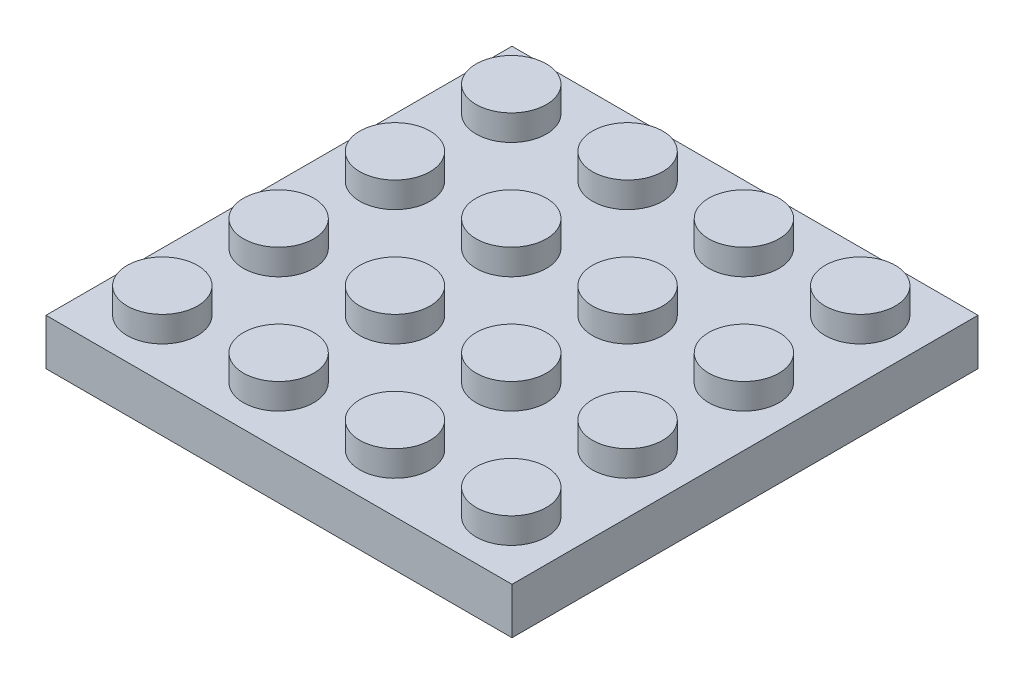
ISO-10303-21;
HEADER;
FILE_DESCRIPTION(('STEP AP214'),'2;1');
FILE_NAME('part.step','',(''),(''),'','','');
FILE_SCHEMA(('AUTOMOTIVE_DESIGN { 1 0 10303 214 1 1 1 1 }'));
ENDSEC;
DATA;
#1=APPLICATION_CONTEXT('core data for automotive mechanical design processes');
#2=APPLICATION_PROTOCOL_DEFINITION('international standard','automotive_design',2000,#1);
#3=PRODUCT_CONTEXT('',#1,'mechanical');
#4=PRODUCT('Part','Part','',(#3));
#5=PRODUCT_RELATED_PRODUCT_CATEGORY('part','',(#4));
#6=PRODUCT_DEFINITION_FORMATION('','',#4);
#7=PRODUCT_DEFINITION_CONTEXT('part definition',#1,'design');
#8=PRODUCT_DEFINITION('design','',#6,#7);
#9=PRODUCT_DEFINITION_SHAPE('','',#8);
#10=(LENGTH_UNIT() NAMED_UNIT(*) SI_UNIT(.MILLI.,.METRE.));
#11=(NAMED_UNIT(*) PLANE_ANGLE_UNIT() SI_UNIT($,.RADIAN.));
#12=(NAMED_UNIT(*) SI_UNIT($,.STERADIAN.) SOLID_ANGLE_UNIT());
#13=UNCERTAINTY_MEASURE_WITH_UNIT(LENGTH_MEASURE(1.E-05),#10,'distance_accuracy_value','');
#14=(GEOMETRIC_REPRESENTATION_CONTEXT(3) GLOBAL_UNCERTAINTY_ASSIGNED_CONTEXT((#13)) GLOBAL_UNIT_ASSIGNED_CONTEXT((#10,
#11,#12)) REPRESENTATION_CONTEXT('',''));
#15=CARTESIAN_POINT('',(0.,0.,0.));
#16=DIRECTION('',(0.,0.,1.));
#17=DIRECTION('',(1.,0.,0.));
#18=AXIS2_PLACEMENT_3D('',#15,#16,#17);
#19=CARTESIAN_POINT('',(-15.9,1.5725,15.9));
#20=DIRECTION('',(0.,1.,0.));
#21=DIRECTION('',(0.,0.,1.));
#22=AXIS2_PLACEMENT_3D('',#19,#20,#21);
#23=PLANE('',#22);
#24=CARTESIAN_POINT('',(3.94375,1.5725,-11.88125));
#25=DIRECTION('',(0.,1.,0.));
#26=DIRECTION('',(0.,0.,1.));
#27=AXIS2_PLACEMENT_3D('',#24,#25,#26);
#28=CIRCLE('',#27,0.812499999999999);
#29=CARTESIAN_POINT('',(3.94375,1.5725,-11.06875));
#30=VERTEX_POINT('',#29);
#31=EDGE_CURVE('E218',#30,#30,#28,.T.);
#32=ORIENTED_EDGE('',*,*,#31,.T.);
#33=EDGE_LOOP('',(#32));
#34=FACE_BOUND('',#33,.T.);
#35=CARTESIAN_POINT('',(-11.93125,1.5725,-11.88125));
#36=DIRECTION('',(0.,1.,0.));
#37=DIRECTION('',(0.,0.,1.));
#38=AXIS2_PLACEMENT_3D('',#35,#36,#37);
#39=CIRCLE('',#38,0.812499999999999);
#40=CARTESIAN_POINT('',(-11.93125,1.5725,-11.06875));
#41=VERTEX_POINT('',#40);
#42=EDGE_CURVE('E213',#41,#41,#39,.T.);
#43=ORIENTED_EDGE('',*,*,#42,.T.);
#44=EDGE_LOOP('',(#43));
#45=FACE_BOUND('',#44,.T.);
#46=CARTESIAN_POINT('',(3.94375,1.5725,-3.94374999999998));
#47=DIRECTION('',(0.,1.,0.));
#48=DIRECTION('',(0.,0.,1.));
#49=AXIS2_PLACEMENT_3D('',#46,#47,#48);
#50=CIRCLE('',#49,0.812499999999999);
#51=CARTESIAN_POINT('',(3.94375,1.5725,-3.13124999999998));
#52=VERTEX_POINT('',#51);
#53=EDGE_CURVE('E208',#52,#52,#50,.T.);
#54=ORIENTED_EDGE('',*,*,#53,.T.);
#55=EDGE_LOOP('',(#54));
#56=FACE_BOUND('',#55,.T.);
#57=CARTESIAN_POINT('',(-11.93125,1.5725,-3.94374999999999));
#58=DIRECTION('',(0.,1.,0.));
#59=DIRECTION('',(0.,0.,1.));
#60=AXIS2_PLACEMENT_3D('',#57,#58,#59);
#61=CIRCLE('',#60,0.812499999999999);
#62=CARTESIAN_POINT('',(-11.93125,1.5725,-3.13124999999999));
#63=VERTEX_POINT('',#62);
#64=EDGE_CURVE('E203',#63,#63,#61,.T.);
#65=ORIENTED_EDGE('',*,*,#64,.T.);
#66=EDGE_LOOP('',(#65));
#67=FACE_BOUND('',#66,.T.);
#68=CARTESIAN_POINT('',(3.94375000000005,1.5725,3.99375000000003));
#69=DIRECTION('',(0.,1.,0.));
#70=DIRECTION('',(0.,0.,1.));
#71=AXIS2_PLACEMENT_3D('',#68,#69,#70);
#72=CIRCLE('',#71,0.812499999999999);
#73=CARTESIAN_POINT('',(3.94375000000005,1.5725,4.80625000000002));
#74=VERTEX_POINT('',#73);
#75=EDGE_CURVE('E198',#74,#74,#72,.T.);
#76=ORIENTED_EDGE('',*,*,#75,.T.);
#77=EDGE_LOOP('',(#76));
#78=FACE_BOUND('',#77,.T.);
#79=CARTESIAN_POINT('',(-11.93125,1.5725,3.99375000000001));
#80=DIRECTION('',(0.,1.,0.));
#81=DIRECTION('',(0.,0.,1.));
#82=AXIS2_PLACEMENT_3D('',#79,#80,#81);
#83=CIRCLE('',#82,0.812499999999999);
#84=CARTESIAN_POINT('',(-11.93125,1.5725,4.80625000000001));
#85=VERTEX_POINT('',#84);
#86=EDGE_CURVE('E193',#85,#85,#83,.T.);
#87=ORIENTED_EDGE('',*,*,#86,.T.);
#88=EDGE_LOOP('',(#87));
#89=FACE_BOUND('',#88,.T.);
#90=CARTESIAN_POINT('',(3.94375,1.5725,11.93125));
#91=DIRECTION('',(0.,1.,0.));
#92=DIRECTION('',(0.,0.,1.));
#93=AXIS2_PLACEMENT_3D('',#90,#91,#92);
#94=CIRCLE('',#93,0.812499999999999);
#95=CARTESIAN_POINT('',(3.94375,1.5725,12.74375));
#96=VERTEX_POINT('',#95);
#97=EDGE_CURVE('E188',#96,#96,#94,.T.);
#98=ORIENTED_EDGE('',*,*,#97,.T.);
#99=EDGE_LOOP('',(#98));
#100=FACE_BOUND('',#99,.T.);
#101=CARTESIAN_POINT('',(-11.93125,1.5725,11.93125));
#102=DIRECTION('',(0.,1.,0.));
#103=DIRECTION('',(0.,0.,1.));
#104=AXIS2_PLACEMENT_3D('',#101,#102,#103);
#105=CIRCLE('',#104,0.812499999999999);
#106=CARTESIAN_POINT('',(-11.93125,1.5725,12.74375));
#107=VERTEX_POINT('',#106);
#108=EDGE_CURVE('E183',#107,#107,#105,.T.);
#109=ORIENTED_EDGE('',*,*,#108,.T.);
#110=EDGE_LOOP('',(#109));
#111=FACE_BOUND('',#110,.T.);
#112=DIRECTION('',(0.,0.,1.));
#113=VECTOR('',#112,1.);
#114=CARTESIAN_POINT('',(-14.3125,1.5725,-15.9));
#115=LINE('',#114,#113);
#116=CARTESIAN_POINT('',(-14.3125,1.5725,-14.3125));
#117=VERTEX_POINT('',#116);
#118=CARTESIAN_POINT('',(-14.3125,1.5725,14.3125));
#119=VERTEX_POINT('',#118);
#120=EDGE_CURVE('E121',#117,#119,#115,.T.);
#121=ORIENTED_EDGE('',*,*,#120,.F.);
#122=DIRECTION('',(-1.,0.,0.));
#123=VECTOR('',#122,1.);
#124=CARTESIAN_POINT('',(-15.9,1.5725,-14.3125));
#125=LINE('',#124,#123);
#126=CARTESIAN_POINT('',(14.3125,1.5725,-14.3125));
#127=VERTEX_POINT('',#126);
#128=EDGE_CURVE('E129',#127,#117,#125,.T.);
#129=ORIENTED_EDGE('',*,*,#128,.F.);
#130=DIRECTION('',(0.,0.,-1.));
#131=VECTOR('',#130,1.);
#132=CARTESIAN_POINT('',(14.3125,1.5725,-15.9));
#133=LINE('',#132,#131);
#134=CARTESIAN_POINT('',(14.3125,1.5725,14.3125));
#135=VERTEX_POINT('',#134);
#136=EDGE_CURVE('E120',#135,#127,#133,.T.);
#137=ORIENTED_EDGE('',*,*,#136,.F.);
#138=DIRECTION('',(1.,0.,0.));
#139=VECTOR('',#138,1.);
#140=CARTESIAN_POINT('',(-15.9,1.5725,14.3125));
#141=LINE('',#140,#139);
#142=EDGE_CURVE('E110',#119,#135,#141,.T.);
#143=ORIENTED_EDGE('',*,*,#142,.F.);
#144=EDGE_LOOP('',(#121,#129,#137,#143));
#145=FACE_BOUND('',#144,.T.);
#146=CARTESIAN_POINT('',(-3.99374999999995,1.5725,11.93125));
#147=DIRECTION('',(0.,1.,0.));
#148=DIRECTION('',(0.,0.,1.));
#149=AXIS2_PLACEMENT_3D('',#146,#147,#148);
#150=CIRCLE('',#149,0.8125);
#151=CARTESIAN_POINT('',(-3.99374999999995,1.5725,12.74375));
#152=VERTEX_POINT('',#151);
#153=EDGE_CURVE('E135',#152,#152,#150,.T.);
#154=ORIENTED_EDGE('',*,*,#153,.T.);
#155=EDGE_LOOP('',(#154));
#156=FACE_BOUND('',#155,.T.);
#157=CARTESIAN_POINT('',(11.88125,1.5725,11.93125));
#158=DIRECTION('',(0.,1.,0.));
#159=DIRECTION('',(0.,0.,1.));
#160=AXIS2_PLACEMENT_3D('',#157,#158,#159);
#161=CIRCLE('',#160,0.812499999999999);
#162=CARTESIAN_POINT('',(11.88125,1.5725,12.74375));
#163=VERTEX_POINT('',#162);
#164=EDGE_CURVE('E140',#163,#163,#161,.T.);
#165=ORIENTED_EDGE('',*,*,#164,.T.);
#166=EDGE_LOOP('',(#165));
#167=FACE_BOUND('',#166,.T.);
#168=CARTESIAN_POINT('',(-3.99374999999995,1.5725,3.99375000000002));
#169=DIRECTION('',(0.,1.,0.));
#170=DIRECTION('',(0.,0.,1.));
#171=AXIS2_PLACEMENT_3D('',#168,#169,#170);
#172=CIRCLE('',#171,0.8125);
#173=CARTESIAN_POINT('',(-3.99374999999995,1.5725,4.80625000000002));
#174=VERTEX_POINT('',#173);
#175=EDGE_CURVE('E145',#174,#174,#172,.T.);
#176=ORIENTED_EDGE('',*,*,#175,.T.);
#177=EDGE_LOOP('',(#176));
#178=FACE_BOUND('',#177,.T.);
#179=CARTESIAN_POINT('',(11.8812500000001,1.5725,3.99375000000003));
#180=DIRECTION('',(0.,1.,0.));
#181=DIRECTION('',(0.,0.,1.));
#182=AXIS2_PLACEMENT_3D('',#179,#180,#181);
#183=CIRCLE('',#182,0.812499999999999);
#184=CARTESIAN_POINT('',(11.8812500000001,1.5725,4.80625000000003));
#185=VERTEX_POINT('',#184);
#186=EDGE_CURVE('E150',#185,#185,#183,.T.);
#187=ORIENTED_EDGE('',*,*,#186,.T.);
#188=EDGE_LOOP('',(#187));
#189=FACE_BOUND('',#188,.T.);
#190=CARTESIAN_POINT('',(-3.99375,1.5725,-3.94374999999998));
#191=DIRECTION('',(0.,1.,0.));
#192=DIRECTION('',(0.,0.,1.));
#193=AXIS2_PLACEMENT_3D('',#190,#191,#192);
#194=CIRCLE('',#193,0.8125);
#195=CARTESIAN_POINT('',(-3.99375,1.5725,-3.13124999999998));
#196=VERTEX_POINT('',#195);
#197=EDGE_CURVE('E155',#196,#196,#194,.T.);
#198=ORIENTED_EDGE('',*,*,#197,.T.);
#199=EDGE_LOOP('',(#198));
#200=FACE_BOUND('',#199,.T.);
#201=CARTESIAN_POINT('',(11.88125,1.5725,-3.94374999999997));
#202=DIRECTION('',(0.,1.,0.));
#203=DIRECTION('',(0.,0.,1.));
#204=AXIS2_PLACEMENT_3D('',#201,#202,#203);
#205=CIRCLE('',#204,0.812499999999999);
#206=CARTESIAN_POINT('',(11.88125,1.5725,-3.13124999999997));
#207=VERTEX_POINT('',#206);
#208=EDGE_CURVE('E160',#207,#207,#205,.T.);
#209=ORIENTED_EDGE('',*,*,#208,.T.);
#210=EDGE_LOOP('',(#209));
#211=FACE_BOUND('',#210,.T.);
#212=CARTESIAN_POINT('',(-3.99375,1.5725,-11.88125));
#213=DIRECTION('',(0.,1.,0.));
#214=DIRECTION('',(0.,0.,1.));
#215=AXIS2_PLACEMENT_3D('',#212,#213,#214);
#216=CIRCLE('',#215,0.8125);
#217=CARTESIAN_POINT('',(-3.99375,1.5725,-11.06875));
#218=VERTEX_POINT('',#217);
#219=EDGE_CURVE('E165',#218,#218,#216,.T.);
#220=ORIENTED_EDGE('',*,*,#219,.T.);
#221=EDGE_LOOP('',(#220));
#222=FACE_BOUND('',#221,.T.);
#223=CARTESIAN_POINT('',(11.88125,1.5725,-11.88125));
#224=DIRECTION('',(0.,1.,0.));
#225=DIRECTION('',(0.,0.,1.));
#226=AXIS2_PLACEMENT_3D('',#223,#224,#225);
#227=CIRCLE('',#226,0.812499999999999);
#228=CARTESIAN_POINT('',(11.88125,1.5725,-11.06875));
#229=VERTEX_POINT('',#228);
#230=EDGE_CURVE('E170',#229,#229,#227,.T.);
#231=ORIENTED_EDGE('',*,*,#230,.T.);
#232=EDGE_LOOP('',(#231));
#233=FACE_BOUND('',#232,.T.);
#234=CARTESIAN_POINT('',(-7.96250000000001,1.5725,7.96250000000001));
#235=DIRECTION('',(0.,1.,0.));
#236=DIRECTION('',(0.,0.,1.));
#237=AXIS2_PLACEMENT_3D('',#234,#235,#236);
#238=CIRCLE('',#237,3.17499999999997);
#239=CARTESIAN_POINT('',(-7.96250000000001,1.5725,11.1375));
#240=VERTEX_POINT('',#239);
#241=EDGE_CURVE('E347',#240,#240,#238,.F.);
#242=ORIENTED_EDGE('',*,*,#241,.F.);
#243=EDGE_LOOP('',(#242));
#244=FACE_BOUND('',#243,.T.);
#245=CARTESIAN_POINT('',(-0.0249999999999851,1.5725,7.96249999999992));
#246=DIRECTION('',(0.,1.,0.));
#247=DIRECTION('',(0.,0.,1.));
#248=AXIS2_PLACEMENT_3D('',#245,#246,#247);
#249=CIRCLE('',#248,3.17500000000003);
#250=CARTESIAN_POINT('',(-0.0249999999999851,1.5725,11.1374999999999));
#251=VERTEX_POINT('',#250);
#252=EDGE_CURVE('E350',#251,#251,#249,.F.);
#253=ORIENTED_EDGE('',*,*,#252,.F.);
#254=EDGE_LOOP('',(#253));
#255=FACE_BOUND('',#254,.T.);
#256=CARTESIAN_POINT('',(7.91249999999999,1.5725,7.96249999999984));
#257=DIRECTION('',(0.,1.,0.));
#258=DIRECTION('',(0.,0.,1.));
#259=AXIS2_PLACEMENT_3D('',#256,#257,#258);
#260=CIRCLE('',#259,3.17499999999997);
#261=CARTESIAN_POINT('',(7.91249999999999,1.5725,11.1374999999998));
#262=VERTEX_POINT('',#261);
#263=EDGE_CURVE('E353',#262,#262,#260,.F.);
#264=ORIENTED_EDGE('',*,*,#263,.F.);
#265=EDGE_LOOP('',(#264));
#266=FACE_BOUND('',#265,.T.);
#267=CARTESIAN_POINT('',(-7.96250000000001,1.5725,0.0250000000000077));
#268=DIRECTION('',(0.,1.,0.));
#269=DIRECTION('',(0.,0.,1.));
#270=AXIS2_PLACEMENT_3D('',#267,#268,#269);
#271=CIRCLE('',#270,3.17499999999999);
#272=CARTESIAN_POINT('',(-7.96250000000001,1.5725,3.2));
#273=VERTEX_POINT('',#272);
#274=EDGE_CURVE('E356',#273,#273,#271,.F.);
#275=ORIENTED_EDGE('',*,*,#274,.F.);
#276=EDGE_LOOP('',(#275));
#277=FACE_BOUND('',#276,.T.);
#278=CARTESIAN_POINT('',(-0.0249999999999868,1.5725,0.0249999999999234));
#279=DIRECTION('',(0.,1.,0.));
#280=DIRECTION('',(0.,0.,1.));
#281=AXIS2_PLACEMENT_3D('',#278,#279,#280);
#282=CIRCLE('',#281,3.17499999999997);
#283=CARTESIAN_POINT('',(-0.0249999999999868,1.5725,3.19999999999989));
#284=VERTEX_POINT('',#283);
#285=EDGE_CURVE('E359',#284,#284,#282,.F.);
#286=ORIENTED_EDGE('',*,*,#285,.F.);
#287=EDGE_LOOP('',(#286));
#288=FACE_BOUND('',#287,.T.);
#289=CARTESIAN_POINT('',(7.91250000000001,1.5725,0.0249999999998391));
#290=DIRECTION('',(0.,1.,0.));
#291=DIRECTION('',(0.,0.,1.));
#292=AXIS2_PLACEMENT_3D('',#289,#290,#291);
#293=CIRCLE('',#292,3.17499999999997);
#294=CARTESIAN_POINT('',(7.91250000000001,1.5725,3.19999999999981));
#295=VERTEX_POINT('',#294);
#296=EDGE_CURVE('E362',#295,#295,#293,.F.);
#297=ORIENTED_EDGE('',*,*,#296,.F.);
#298=EDGE_LOOP('',(#297));
#299=FACE_BOUND('',#298,.T.);
#300=CARTESIAN_POINT('',(-7.96250000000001,1.5725,-7.91249999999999));
#301=DIRECTION('',(0.,1.,0.));
#302=DIRECTION('',(0.,0.,1.));
#303=AXIS2_PLACEMENT_3D('',#300,#301,#302);
#304=CIRCLE('',#303,3.17499999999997);
#305=CARTESIAN_POINT('',(-7.96250000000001,1.5725,-4.73750000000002));
#306=VERTEX_POINT('',#305);
#307=EDGE_CURVE('E365',#306,#306,#304,.F.);
#308=ORIENTED_EDGE('',*,*,#307,.F.);
#309=EDGE_LOOP('',(#308));
#310=FACE_BOUND('',#309,.T.);
#311=CARTESIAN_POINT('',(-0.0250000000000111,1.5725,-7.91250000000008));
#312=DIRECTION('',(0.,1.,0.));
#313=DIRECTION('',(0.,0.,1.));
#314=AXIS2_PLACEMENT_3D('',#311,#312,#313);
#315=CIRCLE('',#314,3.17499999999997);
#316=CARTESIAN_POINT('',(-0.0250000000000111,1.5725,-4.73750000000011));
#317=VERTEX_POINT('',#316);
#318=EDGE_CURVE('E43',#317,#317,#315,.F.);
#319=ORIENTED_EDGE('',*,*,#318,.F.);
#320=EDGE_LOOP('',(#319));
#321=FACE_BOUND('',#320,.T.);
#322=CARTESIAN_POINT('',(7.91249999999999,1.5725,-7.91250000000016));
#323=DIRECTION('',(0.,1.,0.));
#324=DIRECTION('',(0.,0.,1.));
#325=AXIS2_PLACEMENT_3D('',#322,#323,#324);
#326=CIRCLE('',#325,3.17499999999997);
#327=CARTESIAN_POINT('',(7.91249999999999,1.5725,-4.73750000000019));
#328=VERTEX_POINT('',#327);
#329=EDGE_CURVE('E11',#328,#328,#326,.F.);
#330=ORIENTED_EDGE('',*,*,#329,.F.);
#331=EDGE_LOOP('',(#330));
#332=FACE_BOUND('',#331,.T.);
#333=ADVANCED_FACE('F35',(#34,#45,#56,#67,#78,#89,#100,#111,#145,#156,#167,#178,#189,#200,#211,
#222,#233,#244,#255,#266,#277,#288,#299,#310,#321,#332),#23,.F.);
#334=CARTESIAN_POINT('',(-15.9,3.16,15.9));
#335=DIRECTION('',(0.,1.,0.));
#336=DIRECTION('',(0.,0.,1.));
#337=AXIS2_PLACEMENT_3D('',#334,#335,#336);
#338=PLANE('',#337);
#339=CARTESIAN_POINT('',(3.94375,3.16,-11.88125));
#340=DIRECTION('',(0.,1.,0.));
#341=DIRECTION('',(0.,0.,1.));
#342=AXIS2_PLACEMENT_3D('',#339,#340,#341);
#343=CIRCLE('',#342,2.4);
#344=CARTESIAN_POINT('',(3.94375,3.16,-9.48124999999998));
#345=VERTEX_POINT('',#344);
#346=EDGE_CURVE('E232',#345,#345,#343,.T.);
#347=ORIENTED_EDGE('',*,*,#346,.F.);
#348=EDGE_LOOP('',(#347));
#349=FACE_BOUND('',#348,.T.);
#350=CARTESIAN_POINT('',(-11.93125,3.16,-11.88125));
#351=DIRECTION('',(0.,1.,0.));
#352=DIRECTION('',(0.,0.,1.));
#353=AXIS2_PLACEMENT_3D('',#350,#351,#352);
#354=CIRCLE('',#353,2.4);
#355=CARTESIAN_POINT('',(-11.93125,3.16,-9.48124999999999));
#356=VERTEX_POINT('',#355);
#357=EDGE_CURVE('E244',#356,#356,#354,.T.);
#358=ORIENTED_EDGE('',*,*,#357,.F.);
#359=EDGE_LOOP('',(#358));
#360=FACE_BOUND('',#359,.T.);
#361=CARTESIAN_POINT('',(3.94375,3.16,-3.94374999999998));
#362=DIRECTION('',(0.,1.,0.));
#363=DIRECTION('',(0.,0.,1.));
#364=AXIS2_PLACEMENT_3D('',#361,#362,#363);
#365=CIRCLE('',#364,2.4);
#366=CARTESIAN_POINT('',(3.94375,3.16,-1.54374999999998));
#367=VERTEX_POINT('',#366);
#368=EDGE_CURVE('E256',#367,#367,#365,.T.);
#369=ORIENTED_EDGE('',*,*,#368,.F.);
#370=EDGE_LOOP('',(#369));
#371=FACE_BOUND('',#370,.T.);
#372=CARTESIAN_POINT('',(-11.93125,3.16,-3.94374999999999));
#373=DIRECTION('',(0.,1.,0.));
#374=DIRECTION('',(0.,0.,1.));
#375=AXIS2_PLACEMENT_3D('',#372,#373,#374);
#376=CIRCLE('',#375,2.4);
#377=CARTESIAN_POINT('',(-11.93125,3.16,-1.54374999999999));
#378=VERTEX_POINT('',#377);
#379=EDGE_CURVE('E268',#378,#378,#376,.T.);
#380=ORIENTED_EDGE('',*,*,#379,.F.);
#381=EDGE_LOOP('',(#380));
#382=FACE_BOUND('',#381,.T.);
#383=CARTESIAN_POINT('',(3.94375000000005,3.16,3.99375000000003));
#384=DIRECTION('',(0.,1.,0.));
#385=DIRECTION('',(0.,0.,1.));
#386=AXIS2_PLACEMENT_3D('',#383,#384,#385);
#387=CIRCLE('',#386,2.4);
#388=CARTESIAN_POINT('',(3.94375000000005,3.16,6.39375000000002));
#389=VERTEX_POINT('',#388);
#390=EDGE_CURVE('E280',#389,#389,#387,.T.);
#391=ORIENTED_EDGE('',*,*,#390,.F.);
#392=EDGE_LOOP('',(#391));
#393=FACE_BOUND('',#392,.T.);
#394=CARTESIAN_POINT('',(-11.93125,3.16,3.99375000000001));
#395=DIRECTION('',(0.,1.,0.));
#396=DIRECTION('',(0.,0.,1.));
#397=AXIS2_PLACEMENT_3D('',#394,#395,#396);
#398=CIRCLE('',#397,2.4);
#399=CARTESIAN_POINT('',(-11.93125,3.16,6.39375000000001));
#400=VERTEX_POINT('',#399);
#401=EDGE_CURVE('E292',#400,#400,#398,.T.);
#402=ORIENTED_EDGE('',*,*,#401,.F.);
#403=EDGE_LOOP('',(#402));
#404=FACE_BOUND('',#403,.T.);
#405=CARTESIAN_POINT('',(3.94375,3.16,11.93125));
#406=DIRECTION('',(0.,1.,0.));
#407=DIRECTION('',(0.,0.,1.));
#408=AXIS2_PLACEMENT_3D('',#405,#406,#407);
#409=CIRCLE('',#408,2.4);
#410=CARTESIAN_POINT('',(3.94375,3.16,14.33125));
#411=VERTEX_POINT('',#410);
#412=EDGE_CURVE('E304',#411,#411,#409,.T.);
#413=ORIENTED_EDGE('',*,*,#412,.F.);
#414=EDGE_LOOP('',(#413));
#415=FACE_BOUND('',#414,.T.);
#416=CARTESIAN_POINT('',(-11.93125,3.16,11.93125));
#417=DIRECTION('',(0.,1.,0.));
#418=DIRECTION('',(0.,0.,1.));
#419=AXIS2_PLACEMENT_3D('',#416,#417,#418);
#420=CIRCLE('',#419,2.4);
#421=CARTESIAN_POINT('',(-11.93125,3.16,14.33125));
#422=VERTEX_POINT('',#421);
#423=EDGE_CURVE('E316',#422,#422,#420,.T.);
#424=ORIENTED_EDGE('',*,*,#423,.F.);
#425=EDGE_LOOP('',(#424));
#426=FACE_BOUND('',#425,.T.);
#427=DIRECTION('',(0.,0.,1.));
#428=VECTOR('',#427,1.);
#429=CARTESIAN_POINT('',(-15.9,3.16,-15.9));
#430=LINE('',#429,#428);
#431=CARTESIAN_POINT('',(-15.9,3.16,-15.9));
#432=VERTEX_POINT('',#431);
#433=CARTESIAN_POINT('',(-15.9,3.16,15.9));
#434=VERTEX_POINT('',#433);
#435=EDGE_CURVE('E325',#432,#434,#430,.T.);
#436=ORIENTED_EDGE('',*,*,#435,.T.);
#437=DIRECTION('',(1.,0.,0.));
#438=VECTOR('',#437,1.);
#439=CARTESIAN_POINT('',(-15.9,3.16,15.9));
#440=LINE('',#439,#438);
#441=CARTESIAN_POINT('',(15.9,3.16,15.9));
#442=VERTEX_POINT('',#441);
#443=EDGE_CURVE('E88',#434,#442,#440,.T.);
#444=ORIENTED_EDGE('',*,*,#443,.T.);
#445=DIRECTION('',(0.,0.,-1.));
#446=VECTOR('',#445,1.);
#447=CARTESIAN_POINT('',(15.9,3.16,-15.9));
#448=LINE('',#447,#446);
#449=CARTESIAN_POINT('',(15.9,3.16,-15.9));
#450=VERTEX_POINT('',#449);
#451=EDGE_CURVE('E328',#442,#450,#448,.T.);
#452=ORIENTED_EDGE('',*,*,#451,.T.);
#453=DIRECTION('',(-1.,0.,0.));
#454=VECTOR('',#453,1.);
#455=CARTESIAN_POINT('',(-15.9,3.16,-15.9));
#456=LINE('',#455,#454);
#457=EDGE_CURVE('E59',#450,#432,#456,.T.);
#458=ORIENTED_EDGE('',*,*,#457,.T.);
#459=EDGE_LOOP('',(#436,#444,#452,#458));
#460=FACE_BOUND('',#459,.T.);
#461=CARTESIAN_POINT('',(-3.99374999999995,3.16,11.93125));
#462=DIRECTION('',(0.,1.,0.));
#463=DIRECTION('',(0.,0.,1.));
#464=AXIS2_PLACEMENT_3D('',#461,#462,#463);
#465=CIRCLE('',#464,2.4);
#466=CARTESIAN_POINT('',(-3.99374999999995,3.16,14.33125));
#467=VERTEX_POINT('',#466);
#468=EDGE_CURVE('E310',#467,#467,#465,.T.);
#469=ORIENTED_EDGE('',*,*,#468,.F.);
#470=EDGE_LOOP('',(#469));
#471=FACE_BOUND('',#470,.T.);
#472=CARTESIAN_POINT('',(11.88125,3.16,11.93125));
#473=DIRECTION('',(0.,1.,0.));
#474=DIRECTION('',(0.,0.,1.));
#475=AXIS2_PLACEMENT_3D('',#472,#473,#474);
#476=CIRCLE('',#475,2.4);
#477=CARTESIAN_POINT('',(11.88125,3.16,14.33125));
#478=VERTEX_POINT('',#477);
#479=EDGE_CURVE('E298',#478,#478,#476,.T.);
#480=ORIENTED_EDGE('',*,*,#479,.F.);
#481=EDGE_LOOP('',(#480));
#482=FACE_BOUND('',#481,.T.);
#483=CARTESIAN_POINT('',(-3.99374999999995,3.16,3.99375000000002));
#484=DIRECTION('',(0.,1.,0.));
#485=DIRECTION('',(0.,0.,1.));
#486=AXIS2_PLACEMENT_3D('',#483,#484,#485);
#487=CIRCLE('',#486,2.4);
#488=CARTESIAN_POINT('',(-3.99374999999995,3.16,6.39375000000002));
#489=VERTEX_POINT('',#488);
#490=EDGE_CURVE('E286',#489,#489,#487,.T.);
#491=ORIENTED_EDGE('',*,*,#490,.F.);
#492=EDGE_LOOP('',(#491));
#493=FACE_BOUND('',#492,.T.);
#494=CARTESIAN_POINT('',(11.8812500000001,3.16,3.99375000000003));
#495=DIRECTION('',(0.,1.,0.));
#496=DIRECTION('',(0.,0.,1.));
#497=AXIS2_PLACEMENT_3D('',#494,#495,#496);
#498=CIRCLE('',#497,2.4);
#499=CARTESIAN_POINT('',(11.8812500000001,3.16,6.39375000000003));
#500=VERTEX_POINT('',#499);
#501=EDGE_CURVE('E274',#500,#500,#498,.T.);
#502=ORIENTED_EDGE('',*,*,#501,.F.);
#503=EDGE_LOOP('',(#502));
#504=FACE_BOUND('',#503,.T.);
#505=CARTESIAN_POINT('',(-3.99375,3.16,-3.94374999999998));
#506=DIRECTION('',(0.,1.,0.));
#507=DIRECTION('',(0.,0.,1.));
#508=AXIS2_PLACEMENT_3D('',#505,#506,#507);
#509=CIRCLE('',#508,2.4);
#510=CARTESIAN_POINT('',(-3.99375,3.16,-1.54374999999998));
#511=VERTEX_POINT('',#510);
#512=EDGE_CURVE('E262',#511,#511,#509,.T.);
#513=ORIENTED_EDGE('',*,*,#512,.F.);
#514=EDGE_LOOP('',(#513));
#515=FACE_BOUND('',#514,.T.);
#516=CARTESIAN_POINT('',(11.88125,3.16,-3.94374999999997));
#517=DIRECTION('',(0.,1.,0.));
#518=DIRECTION('',(0.,0.,1.));
#519=AXIS2_PLACEMENT_3D('',#516,#517,#518);
#520=CIRCLE('',#519,2.4);
#521=CARTESIAN_POINT('',(11.88125,3.16,-1.54374999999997));
#522=VERTEX_POINT('',#521);
#523=EDGE_CURVE('E250',#522,#522,#520,.T.);
#524=ORIENTED_EDGE('',*,*,#523,.F.);
#525=EDGE_LOOP('',(#524));
#526=FACE_BOUND('',#525,.T.);
#527=CARTESIAN_POINT('',(-3.99375,3.16,-11.88125));
#528=DIRECTION('',(0.,1.,0.));
#529=DIRECTION('',(0.,0.,1.));
#530=AXIS2_PLACEMENT_3D('',#527,#528,#529);
#531=CIRCLE('',#530,2.4);
#532=CARTESIAN_POINT('',(-3.99375,3.16,-9.48124999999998));
#533=VERTEX_POINT('',#532);
#534=EDGE_CURVE('E238',#533,#533,#531,.T.);
#535=ORIENTED_EDGE('',*,*,#534,.F.);
#536=EDGE_LOOP('',(#535));
#537=FACE_BOUND('',#536,.T.);
#538=CARTESIAN_POINT('',(11.88125,3.16,-11.88125));
#539=DIRECTION('',(0.,1.,0.));
#540=DIRECTION('',(0.,0.,1.));
#541=AXIS2_PLACEMENT_3D('',#538,#539,#540);
#542=CIRCLE('',#541,2.4);
#543=CARTESIAN_POINT('',(11.88125,3.16,-9.48124999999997));
#544=VERTEX_POINT('',#543);
#545=EDGE_CURVE('E176',#544,#544,#542,.T.);
#546=ORIENTED_EDGE('',*,*,#545,.F.);
#547=EDGE_LOOP('',(#546));
#548=FACE_BOUND('',#547,.T.);
#549=ADVANCED_FACE('F374',(#349,#360,#371,#382,#393,#404,#415,#426,#460,#471,#482,#493,#504,
#515,#526,#537,#548),#338,.T.);
#550=CARTESIAN_POINT('',(-15.9,3.16,-15.9));
#551=DIRECTION('',(1.,0.,0.));
#552=DIRECTION('',(0.,0.,-1.));
#553=AXIS2_PLACEMENT_3D('',#550,#551,#552);
#554=PLANE('',#553);
#555=DIRECTION('',(0.,0.,1.));
#556=VECTOR('',#555,1.);
#557=CARTESIAN_POINT('',(-15.9,0.,-15.9));
#558=LINE('',#557,#556);
#559=CARTESIAN_POINT('',(-15.9,0.,-15.9));
#560=VERTEX_POINT('',#559);
#561=CARTESIAN_POINT('',(-15.9,0.,15.9));
#562=VERTEX_POINT('',#561);
#563=EDGE_CURVE('E322',#560,#562,#558,.T.);
#564=ORIENTED_EDGE('',*,*,#563,.T.);
#565=DIRECTION('',(0.,-1.,0.));
#566=VECTOR('',#565,1.);
#567=CARTESIAN_POINT('',(-15.9,3.16,15.9));
#568=LINE('',#567,#566);
#569=EDGE_CURVE('E345',#434,#562,#568,.T.);
#570=ORIENTED_EDGE('',*,*,#569,.F.);
#571=ORIENTED_EDGE('',*,*,#435,.F.);
#572=DIRECTION('',(0.,-1.,0.));
#573=VECTOR('',#572,1.);
#574=CARTESIAN_POINT('',(-15.9,3.16,-15.9));
#575=LINE('',#574,#573);
#576=EDGE_CURVE('E331',#432,#560,#575,.T.);
#577=ORIENTED_EDGE('',*,*,#576,.T.);
#578=EDGE_LOOP('',(#564,#570,#571,#577));
#579=FACE_BOUND('',#578,.T.);
#580=ADVANCED_FACE('F37',(#579),#554,.F.);
#581=CARTESIAN_POINT('',(-15.9,3.16,15.9));
#582=DIRECTION('',(0.,0.,-1.));
#583=DIRECTION('',(-1.,0.,0.));
#584=AXIS2_PLACEMENT_3D('',#581,#582,#583);
#585=PLANE('',#584);
#586=DIRECTION('',(1.,0.,0.));
#587=VECTOR('',#586,1.);
#588=CARTESIAN_POINT('',(-15.9,0.,15.9));
#589=LINE('',#588,#587);
#590=CARTESIAN_POINT('',(15.9,0.,15.9));
#591=VERTEX_POINT('',#590);
#592=EDGE_CURVE('E334',#562,#591,#589,.T.);
#593=ORIENTED_EDGE('',*,*,#592,.T.);
#594=DIRECTION('',(0.,-1.,0.));
#595=VECTOR('',#594,1.);
#596=CARTESIAN_POINT('',(15.9,3.16,15.9));
#597=LINE('',#596,#595);
#598=EDGE_CURVE('E342',#442,#591,#597,.T.);
#599=ORIENTED_EDGE('',*,*,#598,.F.);
#600=ORIENTED_EDGE('',*,*,#443,.F.);
#601=ORIENTED_EDGE('',*,*,#569,.T.);
#602=EDGE_LOOP('',(#593,#599,#600,#601));
#603=FACE_BOUND('',#602,.T.);
#604=ADVANCED_FACE('F781',(#603),#585,.F.);
#605=CARTESIAN_POINT('',(15.9,3.16,-15.9));
#606=DIRECTION('',(-1.,0.,0.));
#607=DIRECTION('',(0.,0.,1.));
#608=AXIS2_PLACEMENT_3D('',#605,#606,#607);
#609=PLANE('',#608);
#610=DIRECTION('',(0.,0.,-1.));
#611=VECTOR('',#610,1.);
#612=CARTESIAN_POINT('',(15.9,0.,-15.9));
#613=LINE('',#612,#611);
#614=CARTESIAN_POINT('',(15.9,0.,-15.9));
#615=VERTEX_POINT('',#614);
#616=EDGE_CURVE('E336',#591,#615,#613,.T.);
#617=ORIENTED_EDGE('',*,*,#616,.T.);
#618=DIRECTION('',(0.,-1.,0.));
#619=VECTOR('',#618,1.);
#620=CARTESIAN_POINT('',(15.9,3.16,-15.9));
#621=LINE('',#620,#619);
#622=EDGE_CURVE('E340',#450,#615,#621,.T.);
#623=ORIENTED_EDGE('',*,*,#622,.F.);
#624=ORIENTED_EDGE('',*,*,#451,.F.);
#625=ORIENTED_EDGE('',*,*,#598,.T.);
#626=EDGE_LOOP('',(#617,#623,#624,#625));
#627=FACE_BOUND('',#626,.T.);
#628=ADVANCED_FACE('F779',(#627),#609,.F.);
#629=CARTESIAN_POINT('',(-15.9,3.16,-15.9));
#630=DIRECTION('',(0.,0.,1.));
#631=DIRECTION('',(1.,0.,0.));
#632=AXIS2_PLACEMENT_3D('',#629,#630,#631);
#633=PLANE('',#632);
#634=DIRECTION('',(-1.,0.,0.));
#635=VECTOR('',#634,1.);
#636=CARTESIAN_POINT('',(-15.9,0.,-15.9));
#637=LINE('',#636,#635);
#638=EDGE_CURVE('E80',#615,#560,#637,.T.);
#639=ORIENTED_EDGE('',*,*,#638,.T.);
#640=ORIENTED_EDGE('',*,*,#576,.F.);
#641=ORIENTED_EDGE('',*,*,#457,.F.);
#642=ORIENTED_EDGE('',*,*,#622,.T.);
#643=EDGE_LOOP('',(#639,#640,#641,#642));
#644=FACE_BOUND('',#643,.T.);
#645=ADVANCED_FACE('F775',(#644),#633,.F.);
#646=CARTESIAN_POINT('',(-15.9,0.,15.9));
#647=DIRECTION('',(0.,1.,0.));
#648=DIRECTION('',(0.,0.,1.));
#649=AXIS2_PLACEMENT_3D('',#646,#647,#648);
#650=PLANE('',#649);
#651=DIRECTION('',(-1.,0.,0.));
#652=VECTOR('',#651,1.);
#653=CARTESIAN_POINT('',(-15.9,0.,-14.3125));
#654=LINE('',#653,#652);
#655=CARTESIAN_POINT('',(14.3125,0.,-14.3125));
#656=VERTEX_POINT('',#655);
#657=CARTESIAN_POINT('',(-14.3125,0.,-14.3125));
#658=VERTEX_POINT('',#657);
#659=EDGE_CURVE('E224',#656,#658,#654,.T.);
#660=ORIENTED_EDGE('',*,*,#659,.T.);
#661=DIRECTION('',(0.,0.,1.));
#662=VECTOR('',#661,1.);
#663=CARTESIAN_POINT('',(-14.3125,0.,-15.9));
#664=LINE('',#663,#662);
#665=CARTESIAN_POINT('',(-14.3125,0.,14.3125));
#666=VERTEX_POINT('',#665);
#667=EDGE_CURVE('E182',#658,#666,#664,.T.);
#668=ORIENTED_EDGE('',*,*,#667,.T.);
#669=DIRECTION('',(1.,0.,0.));
#670=VECTOR('',#669,1.);
#671=CARTESIAN_POINT('',(-15.9,0.,14.3125));
#672=LINE('',#671,#670);
#673=CARTESIAN_POINT('',(14.3125,0.,14.3125));
#674=VERTEX_POINT('',#673);
#675=EDGE_CURVE('E223',#666,#674,#672,.T.);
#676=ORIENTED_EDGE('',*,*,#675,.T.);
#677=DIRECTION('',(0.,0.,-1.));
#678=VECTOR('',#677,1.);
#679=CARTESIAN_POINT('',(14.3125,0.,-15.9));
#680=LINE('',#679,#678);
#681=EDGE_CURVE('E50',#674,#656,#680,.T.);
#682=ORIENTED_EDGE('',*,*,#681,.T.);
#683=EDGE_LOOP('',(#660,#668,#676,#682));
#684=FACE_BOUND('',#683,.T.);
#685=ORIENTED_EDGE('',*,*,#563,.F.);
#686=ORIENTED_EDGE('',*,*,#638,.F.);
#687=ORIENTED_EDGE('',*,*,#616,.F.);
#688=ORIENTED_EDGE('',*,*,#592,.F.);
#689=EDGE_LOOP('',(#685,#686,#687,#688));
#690=FACE_BOUND('',#689,.T.);
#691=ADVANCED_FACE('F768',(#684,#690),#650,.F.);
#692=CARTESIAN_POINT('',(-11.93125,4.91,11.93125));
#693=DIRECTION('',(0.,-1.,0.));
#694=DIRECTION('',(0.,0.,-1.));
#695=AXIS2_PLACEMENT_3D('',#692,#693,#694);
#696=CYLINDRICAL_SURFACE('',#695,2.4);
#697=CARTESIAN_POINT('',(-11.93125,4.91,11.93125));
#698=DIRECTION('',(0.,1.,0.));
#699=DIRECTION('',(0.,0.,1.));
#700=AXIS2_PLACEMENT_3D('',#697,#698,#699);
#701=CIRCLE('',#700,2.4);
#702=CARTESIAN_POINT('',(-11.93125,4.91,14.33125));
#703=VERTEX_POINT('',#702);
#704=EDGE_CURVE('E319',#703,#703,#701,.T.);
#705=ORIENTED_EDGE('',*,*,#704,.F.);
#706=EDGE_LOOP('',(#705));
#707=FACE_BOUND('',#706,.T.);
#708=ORIENTED_EDGE('',*,*,#423,.T.);
#709=EDGE_LOOP('',(#708));
#710=FACE_BOUND('',#709,.T.);
#711=ADVANCED_FACE('F764',(#707,#710),#696,.T.);
#712=CARTESIAN_POINT('',(-11.93125,4.91,11.93125));
#713=DIRECTION('',(0.,1.,0.));
#714=DIRECTION('',(0.,0.,1.));
#715=AXIS2_PLACEMENT_3D('',#712,#713,#714);
#716=PLANE('',#715);
#717=ORIENTED_EDGE('',*,*,#704,.T.);
#718=EDGE_LOOP('',(#717));
#719=FACE_BOUND('',#718,.T.);
#720=ADVANCED_FACE('F760',(#719),#716,.T.);
#721=CARTESIAN_POINT('',(-3.99374999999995,4.91,11.93125));
#722=DIRECTION('',(0.,-1.,0.));
#723=DIRECTION('',(0.,0.,-1.));
#724=AXIS2_PLACEMENT_3D('',#721,#722,#723);
#725=CYLINDRICAL_SURFACE('',#724,2.4);
#726=CARTESIAN_POINT('',(-3.99374999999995,4.91,11.93125));
#727=DIRECTION('',(0.,1.,0.));
#728=DIRECTION('',(0.,0.,1.));
#729=AXIS2_PLACEMENT_3D('',#726,#727,#728);
#730=CIRCLE('',#729,2.4);
#731=CARTESIAN_POINT('',(-3.99374999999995,4.91,14.33125));
#732=VERTEX_POINT('',#731);
#733=EDGE_CURVE('E313',#732,#732,#730,.T.);
#734=ORIENTED_EDGE('',*,*,#733,.F.);
#735=EDGE_LOOP('',(#734));
#736=FACE_BOUND('',#735,.T.);
#737=ORIENTED_EDGE('',*,*,#468,.T.);
#738=EDGE_LOOP('',(#737));
#739=FACE_BOUND('',#738,.T.);
#740=ADVANCED_FACE('F756',(#736,#739),#725,.T.);
#741=CARTESIAN_POINT('',(-3.99374999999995,4.91,11.93125));
#742=DIRECTION('',(0.,1.,0.));
#743=DIRECTION('',(0.,0.,1.));
#744=AXIS2_PLACEMENT_3D('',#741,#742,#743);
#745=PLANE('',#744);
#746=ORIENTED_EDGE('',*,*,#733,.T.);
#747=EDGE_LOOP('',(#746));
#748=FACE_BOUND('',#747,.T.);
#749=ADVANCED_FACE('F752',(#748),#745,.T.);
#750=CARTESIAN_POINT('',(3.94375,4.91,11.93125));
#751=DIRECTION('',(0.,-1.,0.));
#752=DIRECTION('',(0.,0.,-1.));
#753=AXIS2_PLACEMENT_3D('',#750,#751,#752);
#754=CYLINDRICAL_SURFACE('',#753,2.4);
#755=CARTESIAN_POINT('',(3.94375,4.91,11.93125));
#756=DIRECTION('',(0.,1.,0.));
#757=DIRECTION('',(0.,0.,1.));
#758=AXIS2_PLACEMENT_3D('',#755,#756,#757);
#759=CIRCLE('',#758,2.4);
#760=CARTESIAN_POINT('',(3.94375,4.91,14.33125));
#761=VERTEX_POINT('',#760);
#762=EDGE_CURVE('E307',#761,#761,#759,.T.);
#763=ORIENTED_EDGE('',*,*,#762,.F.);
#764=EDGE_LOOP('',(#763));
#765=FACE_BOUND('',#764,.T.);
#766=ORIENTED_EDGE('',*,*,#412,.T.);
#767=EDGE_LOOP('',(#766));
#768=FACE_BOUND('',#767,.T.);
#769=ADVANCED_FACE('F748',(#765,#768),#754,.T.);
#770=CARTESIAN_POINT('',(3.94375,4.91,11.93125));
#771=DIRECTION('',(0.,1.,0.));
#772=DIRECTION('',(0.,0.,1.));
#773=AXIS2_PLACEMENT_3D('',#770,#771,#772);
#774=PLANE('',#773);
#775=ORIENTED_EDGE('',*,*,#762,.T.);
#776=EDGE_LOOP('',(#775));
#777=FACE_BOUND('',#776,.T.);
#778=ADVANCED_FACE('F744',(#777),#774,.T.);
#779=CARTESIAN_POINT('',(11.88125,4.91,11.93125));
#780=DIRECTION('',(0.,-1.,0.));
#781=DIRECTION('',(0.,0.,-1.));
#782=AXIS2_PLACEMENT_3D('',#779,#780,#781);
#783=CYLINDRICAL_SURFACE('',#782,2.4);
#784=CARTESIAN_POINT('',(11.88125,4.91,11.93125));
#785=DIRECTION('',(0.,1.,0.));
#786=DIRECTION('',(0.,0.,1.));
#787=AXIS2_PLACEMENT_3D('',#784,#785,#786);
#788=CIRCLE('',#787,2.4);
#789=CARTESIAN_POINT('',(11.88125,4.91,14.33125));
#790=VERTEX_POINT('',#789);
#791=EDGE_CURVE('E301',#790,#790,#788,.T.);
#792=ORIENTED_EDGE('',*,*,#791,.F.);
#793=EDGE_LOOP('',(#792));
#794=FACE_BOUND('',#793,.T.);
#795=ORIENTED_EDGE('',*,*,#479,.T.);
#796=EDGE_LOOP('',(#795));
#797=FACE_BOUND('',#796,.T.);
#798=ADVANCED_FACE('F740',(#794,#797),#783,.T.);
#799=CARTESIAN_POINT('',(11.88125,4.91,11.93125));
#800=DIRECTION('',(0.,1.,0.));
#801=DIRECTION('',(0.,0.,1.));
#802=AXIS2_PLACEMENT_3D('',#799,#800,#801);
#803=PLANE('',#802);
#804=ORIENTED_EDGE('',*,*,#791,.T.);
#805=EDGE_LOOP('',(#804));
#806=FACE_BOUND('',#805,.T.);
#807=ADVANCED_FACE('F736',(#806),#803,.T.);
#808=CARTESIAN_POINT('',(-11.93125,4.91,3.99375000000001));
#809=DIRECTION('',(0.,-1.,0.));
#810=DIRECTION('',(0.,0.,-1.));
#811=AXIS2_PLACEMENT_3D('',#808,#809,#810);
#812=CYLINDRICAL_SURFACE('',#811,2.4);
#813=CARTESIAN_POINT('',(-11.93125,4.91,3.99375000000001));
#814=DIRECTION('',(0.,1.,0.));
#815=DIRECTION('',(0.,0.,1.));
#816=AXIS2_PLACEMENT_3D('',#813,#814,#815);
#817=CIRCLE('',#816,2.4);
#818=CARTESIAN_POINT('',(-11.93125,4.91,6.39375000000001));
#819=VERTEX_POINT('',#818);
#820=EDGE_CURVE('E295',#819,#819,#817,.T.);
#821=ORIENTED_EDGE('',*,*,#820,.F.);
#822=EDGE_LOOP('',(#821));
#823=FACE_BOUND('',#822,.T.);
#824=ORIENTED_EDGE('',*,*,#401,.T.);
#825=EDGE_LOOP('',(#824));
#826=FACE_BOUND('',#825,.T.);
#827=ADVANCED_FACE('F732',(#823,#826),#812,.T.);
#828=CARTESIAN_POINT('',(-11.93125,4.91,3.99375000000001));
#829=DIRECTION('',(0.,1.,0.));
#830=DIRECTION('',(0.,0.,1.));
#831=AXIS2_PLACEMENT_3D('',#828,#829,#830);
#832=PLANE('',#831);
#833=ORIENTED_EDGE('',*,*,#820,.T.);
#834=EDGE_LOOP('',(#833));
#835=FACE_BOUND('',#834,.T.);
#836=ADVANCED_FACE('F728',(#835),#832,.T.);
#837=CARTESIAN_POINT('',(-3.99374999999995,4.91,3.99375000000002));
#838=DIRECTION('',(0.,-1.,0.));
#839=DIRECTION('',(0.,0.,-1.));
#840=AXIS2_PLACEMENT_3D('',#837,#838,#839);
#841=CYLINDRICAL_SURFACE('',#840,2.4);
#842=CARTESIAN_POINT('',(-3.99374999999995,4.91,3.99375000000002));
#843=DIRECTION('',(0.,1.,0.));
#844=DIRECTION('',(0.,0.,1.));
#845=AXIS2_PLACEMENT_3D('',#842,#843,#844);
#846=CIRCLE('',#845,2.4);
#847=CARTESIAN_POINT('',(-3.99374999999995,4.91,6.39375000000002));
#848=VERTEX_POINT('',#847);
#849=EDGE_CURVE('E289',#848,#848,#846,.T.);
#850=ORIENTED_EDGE('',*,*,#849,.F.);
#851=EDGE_LOOP('',(#850));
#852=FACE_BOUND('',#851,.T.);
#853=ORIENTED_EDGE('',*,*,#490,.T.);
#854=EDGE_LOOP('',(#853));
#855=FACE_BOUND('',#854,.T.);
#856=ADVANCED_FACE('F724',(#852,#855),#841,.T.);
#857=CARTESIAN_POINT('',(-3.99374999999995,4.91,3.99375000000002));
#858=DIRECTION('',(0.,1.,0.));
#859=DIRECTION('',(0.,0.,1.));
#860=AXIS2_PLACEMENT_3D('',#857,#858,#859);
#861=PLANE('',#860);
#862=ORIENTED_EDGE('',*,*,#849,.T.);
#863=EDGE_LOOP('',(#862));
#864=FACE_BOUND('',#863,.T.);
#865=ADVANCED_FACE('F720',(#864),#861,.T.);
#866=CARTESIAN_POINT('',(3.94375000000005,4.91,3.99375000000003));
#867=DIRECTION('',(0.,-1.,0.));
#868=DIRECTION('',(0.,0.,-1.));
#869=AXIS2_PLACEMENT_3D('',#866,#867,#868);
#870=CYLINDRICAL_SURFACE('',#869,2.4);
#871=CARTESIAN_POINT('',(3.94375000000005,4.91,3.99375000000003));
#872=DIRECTION('',(0.,1.,0.));
#873=DIRECTION('',(0.,0.,1.));
#874=AXIS2_PLACEMENT_3D('',#871,#872,#873);
#875=CIRCLE('',#874,2.4);
#876=CARTESIAN_POINT('',(3.94375000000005,4.91,6.39375000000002));
#877=VERTEX_POINT('',#876);
#878=EDGE_CURVE('E283',#877,#877,#875,.T.);
#879=ORIENTED_EDGE('',*,*,#878,.F.);
#880=EDGE_LOOP('',(#879));
#881=FACE_BOUND('',#880,.T.);
#882=ORIENTED_EDGE('',*,*,#390,.T.);
#883=EDGE_LOOP('',(#882));
#884=FACE_BOUND('',#883,.T.);
#885=ADVANCED_FACE('F716',(#881,#884),#870,.T.);
#886=CARTESIAN_POINT('',(3.94375000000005,4.91,3.99375000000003));
#887=DIRECTION('',(0.,1.,0.));
#888=DIRECTION('',(0.,0.,1.));
#889=AXIS2_PLACEMENT_3D('',#886,#887,#888);
#890=PLANE('',#889);
#891=ORIENTED_EDGE('',*,*,#878,.T.);
#892=EDGE_LOOP('',(#891));
#893=FACE_BOUND('',#892,.T.);
#894=ADVANCED_FACE('F712',(#893),#890,.T.);
#895=CARTESIAN_POINT('',(11.8812500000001,4.91,3.99375000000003));
#896=DIRECTION('',(0.,-1.,0.));
#897=DIRECTION('',(0.,0.,-1.));
#898=AXIS2_PLACEMENT_3D('',#895,#896,#897);
#899=CYLINDRICAL_SURFACE('',#898,2.4);
#900=CARTESIAN_POINT('',(11.8812500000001,4.91,3.99375000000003));
#901=DIRECTION('',(0.,1.,0.));
#902=DIRECTION('',(0.,0.,1.));
#903=AXIS2_PLACEMENT_3D('',#900,#901,#902);
#904=CIRCLE('',#903,2.4);
#905=CARTESIAN_POINT('',(11.8812500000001,4.91,6.39375000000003));
#906=VERTEX_POINT('',#905);
#907=EDGE_CURVE('E277',#906,#906,#904,.T.);
#908=ORIENTED_EDGE('',*,*,#907,.F.);
#909=EDGE_LOOP('',(#908));
#910=FACE_BOUND('',#909,.T.);
#911=ORIENTED_EDGE('',*,*,#501,.T.);
#912=EDGE_LOOP('',(#911));
#913=FACE_BOUND('',#912,.T.);
#914=ADVANCED_FACE('F708',(#910,#913),#899,.T.);
#915=CARTESIAN_POINT('',(11.8812500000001,4.91,3.99375000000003));
#916=DIRECTION('',(0.,1.,0.));
#917=DIRECTION('',(0.,0.,1.));
#918=AXIS2_PLACEMENT_3D('',#915,#916,#917);
#919=PLANE('',#918);
#920=ORIENTED_EDGE('',*,*,#907,.T.);
#921=EDGE_LOOP('',(#920));
#922=FACE_BOUND('',#921,.T.);
#923=ADVANCED_FACE('F704',(#922),#919,.T.);
#924=CARTESIAN_POINT('',(-11.93125,4.91,-3.94374999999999));
#925=DIRECTION('',(0.,-1.,0.));
#926=DIRECTION('',(0.,0.,-1.));
#927=AXIS2_PLACEMENT_3D('',#924,#925,#926);
#928=CYLINDRICAL_SURFACE('',#927,2.4);
#929=CARTESIAN_POINT('',(-11.93125,4.91,-3.94374999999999));
#930=DIRECTION('',(0.,1.,0.));
#931=DIRECTION('',(0.,0.,1.));
#932=AXIS2_PLACEMENT_3D('',#929,#930,#931);
#933=CIRCLE('',#932,2.4);
#934=CARTESIAN_POINT('',(-11.93125,4.91,-1.54374999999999));
#935=VERTEX_POINT('',#934);
#936=EDGE_CURVE('E271',#935,#935,#933,.T.);
#937=ORIENTED_EDGE('',*,*,#936,.F.);
#938=EDGE_LOOP('',(#937));
#939=FACE_BOUND('',#938,.T.);
#940=ORIENTED_EDGE('',*,*,#379,.T.);
#941=EDGE_LOOP('',(#940));
#942=FACE_BOUND('',#941,.T.);
#943=ADVANCED_FACE('F700',(#939,#942),#928,.T.);
#944=CARTESIAN_POINT('',(-11.93125,4.91,-3.94374999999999));
#945=DIRECTION('',(0.,1.,0.));
#946=DIRECTION('',(0.,0.,1.));
#947=AXIS2_PLACEMENT_3D('',#944,#945,#946);
#948=PLANE('',#947);
#949=ORIENTED_EDGE('',*,*,#936,.T.);
#950=EDGE_LOOP('',(#949));
#951=FACE_BOUND('',#950,.T.);
#952=ADVANCED_FACE('F696',(#951),#948,.T.);
#953=CARTESIAN_POINT('',(-3.99375,4.91,-3.94374999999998));
#954=DIRECTION('',(0.,-1.,0.));
#955=DIRECTION('',(0.,0.,-1.));
#956=AXIS2_PLACEMENT_3D('',#953,#954,#955);
#957=CYLINDRICAL_SURFACE('',#956,2.4);
#958=CARTESIAN_POINT('',(-3.99375,4.91,-3.94374999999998));
#959=DIRECTION('',(0.,1.,0.));
#960=DIRECTION('',(0.,0.,1.));
#961=AXIS2_PLACEMENT_3D('',#958,#959,#960);
#962=CIRCLE('',#961,2.4);
#963=CARTESIAN_POINT('',(-3.99375,4.91,-1.54374999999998));
#964=VERTEX_POINT('',#963);
#965=EDGE_CURVE('E265',#964,#964,#962,.T.);
#966=ORIENTED_EDGE('',*,*,#965,.F.);
#967=EDGE_LOOP('',(#966));
#968=FACE_BOUND('',#967,.T.);
#969=ORIENTED_EDGE('',*,*,#512,.T.);
#970=EDGE_LOOP('',(#969));
#971=FACE_BOUND('',#970,.T.);
#972=ADVANCED_FACE('F692',(#968,#971),#957,.T.);
#973=CARTESIAN_POINT('',(-3.99375,4.91,-3.94374999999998));
#974=DIRECTION('',(0.,1.,0.));
#975=DIRECTION('',(0.,0.,1.));
#976=AXIS2_PLACEMENT_3D('',#973,#974,#975);
#977=PLANE('',#976);
#978=ORIENTED_EDGE('',*,*,#965,.T.);
#979=EDGE_LOOP('',(#978));
#980=FACE_BOUND('',#979,.T.);
#981=ADVANCED_FACE('F688',(#980),#977,.T.);
#982=CARTESIAN_POINT('',(3.94375,4.91,-3.94374999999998));
#983=DIRECTION('',(0.,-1.,0.));
#984=DIRECTION('',(0.,0.,-1.));
#985=AXIS2_PLACEMENT_3D('',#982,#983,#984);
#986=CYLINDRICAL_SURFACE('',#985,2.4);
#987=CARTESIAN_POINT('',(3.94375,4.91,-3.94374999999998));
#988=DIRECTION('',(0.,1.,0.));
#989=DIRECTION('',(0.,0.,1.));
#990=AXIS2_PLACEMENT_3D('',#987,#988,#989);
#991=CIRCLE('',#990,2.4);
#992=CARTESIAN_POINT('',(3.94375,4.91,-1.54374999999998));
#993=VERTEX_POINT('',#992);
#994=EDGE_CURVE('E259',#993,#993,#991,.T.);
#995=ORIENTED_EDGE('',*,*,#994,.F.);
#996=EDGE_LOOP('',(#995));
#997=FACE_BOUND('',#996,.T.);
#998=ORIENTED_EDGE('',*,*,#368,.T.);
#999=EDGE_LOOP('',(#998));
#1000=FACE_BOUND('',#999,.T.);
#1001=ADVANCED_FACE('F684',(#997,#1000),#986,.T.);
#1002=CARTESIAN_POINT('',(3.94375,4.91,-3.94374999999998));
#1003=DIRECTION('',(0.,1.,0.));
#1004=DIRECTION('',(0.,0.,1.));
#1005=AXIS2_PLACEMENT_3D('',#1002,#1003,#1004);
#1006=PLANE('',#1005);
#1007=ORIENTED_EDGE('',*,*,#994,.T.);
#1008=EDGE_LOOP('',(#1007));
#1009=FACE_BOUND('',#1008,.T.);
#1010=ADVANCED_FACE('F680',(#1009),#1006,.T.);
#1011=CARTESIAN_POINT('',(11.88125,4.91,-3.94374999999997));
#1012=DIRECTION('',(0.,-1.,0.));
#1013=DIRECTION('',(0.,0.,-1.));
#1014=AXIS2_PLACEMENT_3D('',#1011,#1012,#1013);
#1015=CYLINDRICAL_SURFACE('',#1014,2.4);
#1016=CARTESIAN_POINT('',(11.88125,4.91,-3.94374999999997));
#1017=DIRECTION('',(0.,1.,0.));
#1018=DIRECTION('',(0.,0.,1.));
#1019=AXIS2_PLACEMENT_3D('',#1016,#1017,#1018);
#1020=CIRCLE('',#1019,2.4);
#1021=CARTESIAN_POINT('',(11.88125,4.91,-1.54374999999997));
#1022=VERTEX_POINT('',#1021);
#1023=EDGE_CURVE('E253',#1022,#1022,#1020,.T.);
#1024=ORIENTED_EDGE('',*,*,#1023,.F.);
#1025=EDGE_LOOP('',(#1024));
#1026=FACE_BOUND('',#1025,.T.);
#1027=ORIENTED_EDGE('',*,*,#523,.T.);
#1028=EDGE_LOOP('',(#1027));
#1029=FACE_BOUND('',#1028,.T.);
#1030=ADVANCED_FACE('F676',(#1026,#1029),#1015,.T.);
#1031=CARTESIAN_POINT('',(11.88125,4.91,-3.94374999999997));
#1032=DIRECTION('',(0.,1.,0.));
#1033=DIRECTION('',(0.,0.,1.));
#1034=AXIS2_PLACEMENT_3D('',#1031,#1032,#1033);
#1035=PLANE('',#1034);
#1036=ORIENTED_EDGE('',*,*,#1023,.T.);
#1037=EDGE_LOOP('',(#1036));
#1038=FACE_BOUND('',#1037,.T.);
#1039=ADVANCED_FACE('F672',(#1038),#1035,.T.);
#1040=CARTESIAN_POINT('',(-11.93125,4.91,-11.88125));
#1041=DIRECTION('',(0.,-1.,0.));
#1042=DIRECTION('',(0.,0.,-1.));
#1043=AXIS2_PLACEMENT_3D('',#1040,#1041,#1042);
#1044=CYLINDRICAL_SURFACE('',#1043,2.4);
#1045=CARTESIAN_POINT('',(-11.93125,4.91,-11.88125));
#1046=DIRECTION('',(0.,1.,0.));
#1047=DIRECTION('',(0.,0.,1.));
#1048=AXIS2_PLACEMENT_3D('',#1045,#1046,#1047);
#1049=CIRCLE('',#1048,2.4);
#1050=CARTESIAN_POINT('',(-11.93125,4.91,-9.48124999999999));
#1051=VERTEX_POINT('',#1050);
#1052=EDGE_CURVE('E247',#1051,#1051,#1049,.T.);
#1053=ORIENTED_EDGE('',*,*,#1052,.F.);
#1054=EDGE_LOOP('',(#1053));
#1055=FACE_BOUND('',#1054,.T.);
#1056=ORIENTED_EDGE('',*,*,#357,.T.);
#1057=EDGE_LOOP('',(#1056));
#1058=FACE_BOUND('',#1057,.T.);
#1059=ADVANCED_FACE('F668',(#1055,#1058),#1044,.T.);
#1060=CARTESIAN_POINT('',(-11.93125,4.91,-11.88125));
#1061=DIRECTION('',(0.,1.,0.));
#1062=DIRECTION('',(0.,0.,1.));
#1063=AXIS2_PLACEMENT_3D('',#1060,#1061,#1062);
#1064=PLANE('',#1063);
#1065=ORIENTED_EDGE('',*,*,#1052,.T.);
#1066=EDGE_LOOP('',(#1065));
#1067=FACE_BOUND('',#1066,.T.);
#1068=ADVANCED_FACE('F664',(#1067),#1064,.T.);
#1069=CARTESIAN_POINT('',(-3.99375,4.91,-11.88125));
#1070=DIRECTION('',(0.,-1.,0.));
#1071=DIRECTION('',(0.,0.,-1.));
#1072=AXIS2_PLACEMENT_3D('',#1069,#1070,#1071);
#1073=CYLINDRICAL_SURFACE('',#1072,2.4);
#1074=CARTESIAN_POINT('',(-3.99375,4.91,-11.88125));
#1075=DIRECTION('',(0.,1.,0.));
#1076=DIRECTION('',(0.,0.,1.));
#1077=AXIS2_PLACEMENT_3D('',#1074,#1075,#1076);
#1078=CIRCLE('',#1077,2.4);
#1079=CARTESIAN_POINT('',(-3.99375,4.91,-9.48124999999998));
#1080=VERTEX_POINT('',#1079);
#1081=EDGE_CURVE('E241',#1080,#1080,#1078,.T.);
#1082=ORIENTED_EDGE('',*,*,#1081,.F.);
#1083=EDGE_LOOP('',(#1082));
#1084=FACE_BOUND('',#1083,.T.);
#1085=ORIENTED_EDGE('',*,*,#534,.T.);
#1086=EDGE_LOOP('',(#1085));
#1087=FACE_BOUND('',#1086,.T.);
#1088=ADVANCED_FACE('F660',(#1084,#1087),#1073,.T.);
#1089=CARTESIAN_POINT('',(-3.99375,4.91,-11.88125));
#1090=DIRECTION('',(0.,1.,0.));
#1091=DIRECTION('',(0.,0.,1.));
#1092=AXIS2_PLACEMENT_3D('',#1089,#1090,#1091);
#1093=PLANE('',#1092);
#1094=ORIENTED_EDGE('',*,*,#1081,.T.);
#1095=EDGE_LOOP('',(#1094));
#1096=FACE_BOUND('',#1095,.T.);
#1097=ADVANCED_FACE('F656',(#1096),#1093,.T.);
#1098=CARTESIAN_POINT('',(3.94375,4.91,-11.88125));
#1099=DIRECTION('',(0.,-1.,0.));
#1100=DIRECTION('',(0.,0.,-1.));
#1101=AXIS2_PLACEMENT_3D('',#1098,#1099,#1100);
#1102=CYLINDRICAL_SURFACE('',#1101,2.4);
#1103=CARTESIAN_POINT('',(3.94375,4.91,-11.88125));
#1104=DIRECTION('',(0.,1.,0.));
#1105=DIRECTION('',(0.,0.,1.));
#1106=AXIS2_PLACEMENT_3D('',#1103,#1104,#1105);
#1107=CIRCLE('',#1106,2.4);
#1108=CARTESIAN_POINT('',(3.94375,4.91,-9.48124999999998));
#1109=VERTEX_POINT('',#1108);
#1110=EDGE_CURVE('E235',#1109,#1109,#1107,.T.);
#1111=ORIENTED_EDGE('',*,*,#1110,.F.);
#1112=EDGE_LOOP('',(#1111));
#1113=FACE_BOUND('',#1112,.T.);
#1114=ORIENTED_EDGE('',*,*,#346,.T.);
#1115=EDGE_LOOP('',(#1114));
#1116=FACE_BOUND('',#1115,.T.);
#1117=ADVANCED_FACE('F652',(#1113,#1116),#1102,.T.);
#1118=CARTESIAN_POINT('',(3.94375,4.91,-11.88125));
#1119=DIRECTION('',(0.,1.,0.));
#1120=DIRECTION('',(0.,0.,1.));
#1121=AXIS2_PLACEMENT_3D('',#1118,#1119,#1120);
#1122=PLANE('',#1121);
#1123=ORIENTED_EDGE('',*,*,#1110,.T.);
#1124=EDGE_LOOP('',(#1123));
#1125=FACE_BOUND('',#1124,.T.);
#1126=ADVANCED_FACE('F648',(#1125),#1122,.T.);
#1127=CARTESIAN_POINT('',(11.88125,4.91,-11.88125));
#1128=DIRECTION('',(0.,-1.,0.));
#1129=DIRECTION('',(0.,0.,-1.));
#1130=AXIS2_PLACEMENT_3D('',#1127,#1128,#1129);
#1131=CYLINDRICAL_SURFACE('',#1130,2.4);
#1132=CARTESIAN_POINT('',(11.88125,4.91,-11.88125));
#1133=DIRECTION('',(0.,1.,0.));
#1134=DIRECTION('',(0.,0.,1.));
#1135=AXIS2_PLACEMENT_3D('',#1132,#1133,#1134);
#1136=CIRCLE('',#1135,2.4);
#1137=CARTESIAN_POINT('',(11.88125,4.91,-9.48124999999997));
#1138=VERTEX_POINT('',#1137);
#1139=EDGE_CURVE('E229',#1138,#1138,#1136,.T.);
#1140=ORIENTED_EDGE('',*,*,#1139,.F.);
#1141=EDGE_LOOP('',(#1140));
#1142=FACE_BOUND('',#1141,.T.);
#1143=ORIENTED_EDGE('',*,*,#545,.T.);
#1144=EDGE_LOOP('',(#1143));
#1145=FACE_BOUND('',#1144,.T.);
#1146=ADVANCED_FACE('F644',(#1142,#1145),#1131,.T.);
#1147=CARTESIAN_POINT('',(11.88125,4.91,-11.88125));
#1148=DIRECTION('',(0.,1.,0.));
#1149=DIRECTION('',(0.,0.,1.));
#1150=AXIS2_PLACEMENT_3D('',#1147,#1148,#1149);
#1151=PLANE('',#1150);
#1152=ORIENTED_EDGE('',*,*,#1139,.T.);
#1153=EDGE_LOOP('',(#1152));
#1154=FACE_BOUND('',#1153,.T.);
#1155=ADVANCED_FACE('F505',(#1154),#1151,.T.);
#1156=CARTESIAN_POINT('',(-14.3125,3.16,-15.9));
#1157=DIRECTION('',(1.,0.,0.));
#1158=DIRECTION('',(0.,0.,-1.));
#1159=AXIS2_PLACEMENT_3D('',#1156,#1157,#1158);
#1160=PLANE('',#1159);
#1161=ORIENTED_EDGE('',*,*,#667,.F.);
#1162=DIRECTION('',(0.,-1.,0.));
#1163=VECTOR('',#1162,1.);
#1164=CARTESIAN_POINT('',(-14.3125,3.16,-14.3125));
#1165=LINE('',#1164,#1163);
#1166=EDGE_CURVE('E131',#117,#658,#1165,.T.);
#1167=ORIENTED_EDGE('',*,*,#1166,.F.);
#1168=ORIENTED_EDGE('',*,*,#120,.T.);
#1169=DIRECTION('',(0.,-1.,0.));
#1170=VECTOR('',#1169,1.);
#1171=CARTESIAN_POINT('',(-14.3125,3.16,14.3125));
#1172=LINE('',#1171,#1170);
#1173=EDGE_CURVE('E115',#119,#666,#1172,.T.);
#1174=ORIENTED_EDGE('',*,*,#1173,.T.);
#1175=EDGE_LOOP('',(#1161,#1167,#1168,#1174));
#1176=FACE_BOUND('',#1175,.T.);
#1177=ADVANCED_FACE('F502',(#1176),#1160,.T.);
#1178=CARTESIAN_POINT('',(-15.9,3.16,14.3125));
#1179=DIRECTION('',(0.,0.,-1.));
#1180=DIRECTION('',(-1.,0.,0.));
#1181=AXIS2_PLACEMENT_3D('',#1178,#1179,#1180);
#1182=PLANE('',#1181);
#1183=ORIENTED_EDGE('',*,*,#675,.F.);
#1184=ORIENTED_EDGE('',*,*,#1173,.F.);
#1185=ORIENTED_EDGE('',*,*,#142,.T.);
#1186=DIRECTION('',(0.,-1.,0.));
#1187=VECTOR('',#1186,1.);
#1188=CARTESIAN_POINT('',(14.3125,3.16,14.3125));
#1189=LINE('',#1188,#1187);
#1190=EDGE_CURVE('E112',#135,#674,#1189,.T.);
#1191=ORIENTED_EDGE('',*,*,#1190,.T.);
#1192=EDGE_LOOP('',(#1183,#1184,#1185,#1191));
#1193=FACE_BOUND('',#1192,.T.);
#1194=ADVANCED_FACE('F111',(#1193),#1182,.T.);
#1195=CARTESIAN_POINT('',(14.3125,3.16,-15.9));
#1196=DIRECTION('',(-1.,0.,0.));
#1197=DIRECTION('',(0.,0.,1.));
#1198=AXIS2_PLACEMENT_3D('',#1195,#1196,#1197);
#1199=PLANE('',#1198);
#1200=ORIENTED_EDGE('',*,*,#681,.F.);
#1201=ORIENTED_EDGE('',*,*,#1190,.F.);
#1202=ORIENTED_EDGE('',*,*,#136,.T.);
#1203=DIRECTION('',(0.,-1.,0.));
#1204=VECTOR('',#1203,1.);
#1205=CARTESIAN_POINT('',(14.3125,3.16,-14.3125));
#1206=LINE('',#1205,#1204);
#1207=EDGE_CURVE('E125',#127,#656,#1206,.T.);
#1208=ORIENTED_EDGE('',*,*,#1207,.T.);
#1209=EDGE_LOOP('',(#1200,#1201,#1202,#1208));
#1210=FACE_BOUND('',#1209,.T.);
#1211=ADVANCED_FACE('F123',(#1210),#1199,.T.);
#1212=CARTESIAN_POINT('',(-15.9,3.16,-14.3125));
#1213=DIRECTION('',(0.,0.,1.));
#1214=DIRECTION('',(1.,0.,0.));
#1215=AXIS2_PLACEMENT_3D('',#1212,#1213,#1214);
#1216=PLANE('',#1215);
#1217=ORIENTED_EDGE('',*,*,#659,.F.);
#1218=ORIENTED_EDGE('',*,*,#1207,.F.);
#1219=ORIENTED_EDGE('',*,*,#128,.T.);
#1220=ORIENTED_EDGE('',*,*,#1166,.T.);
#1221=EDGE_LOOP('',(#1217,#1218,#1219,#1220));
#1222=FACE_BOUND('',#1221,.T.);
#1223=ADVANCED_FACE('F511',(#1222),#1216,.T.);
#1224=CARTESIAN_POINT('',(-11.93125,4.91,11.93125));
#1225=DIRECTION('',(0.,-1.,0.));
#1226=DIRECTION('',(0.,0.,-1.));
#1227=AXIS2_PLACEMENT_3D('',#1224,#1225,#1226);
#1228=CYLINDRICAL_SURFACE('',#1227,0.812499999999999);
#1229=CARTESIAN_POINT('',(-11.93125,3.3225,11.93125));
#1230=DIRECTION('',(0.,1.,0.));
#1231=DIRECTION('',(0.,0.,1.));
#1232=AXIS2_PLACEMENT_3D('',#1229,#1230,#1231);
#1233=CIRCLE('',#1232,0.812499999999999);
#1234=CARTESIAN_POINT('',(-11.93125,3.3225,12.74375));
#1235=VERTEX_POINT('',#1234);
#1236=EDGE_CURVE('E179',#1235,#1235,#1233,.T.);
#1237=ORIENTED_EDGE('',*,*,#1236,.T.);
#1238=EDGE_LOOP('',(#1237));
#1239=FACE_BOUND('',#1238,.T.);
#1240=ORIENTED_EDGE('',*,*,#108,.F.);
#1241=EDGE_LOOP('',(#1240));
#1242=FACE_BOUND('',#1241,.T.);
#1243=ADVANCED_FACE('F514',(#1239,#1242),#1228,.F.);
#1244=CARTESIAN_POINT('',(-11.93125,3.3225,11.93125));
#1245=DIRECTION('',(0.,1.,0.));
#1246=DIRECTION('',(0.,0.,1.));
#1247=AXIS2_PLACEMENT_3D('',#1244,#1245,#1246);
#1248=PLANE('',#1247);
#1249=ORIENTED_EDGE('',*,*,#1236,.F.);
#1250=EDGE_LOOP('',(#1249));
#1251=FACE_BOUND('',#1250,.T.);
#1252=ADVANCED_FACE('F518',(#1251),#1248,.F.);
#1253=CARTESIAN_POINT('',(-3.99374999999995,4.91,11.93125));
#1254=DIRECTION('',(0.,-1.,0.));
#1255=DIRECTION('',(0.,0.,-1.));
#1256=AXIS2_PLACEMENT_3D('',#1253,#1254,#1255);
#1257=CYLINDRICAL_SURFACE('',#1256,0.8125);
#1258=CARTESIAN_POINT('',(-3.99374999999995,3.3225,11.93125));
#1259=DIRECTION('',(0.,1.,0.));
#1260=DIRECTION('',(0.,0.,1.));
#1261=AXIS2_PLACEMENT_3D('',#1258,#1259,#1260);
#1262=CIRCLE('',#1261,0.8125);
#1263=CARTESIAN_POINT('',(-3.99374999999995,3.3225,12.74375));
#1264=VERTEX_POINT('',#1263);
#1265=EDGE_CURVE('E138',#1264,#1264,#1262,.T.);
#1266=ORIENTED_EDGE('',*,*,#1265,.T.);
#1267=EDGE_LOOP('',(#1266));
#1268=FACE_BOUND('',#1267,.T.);
#1269=ORIENTED_EDGE('',*,*,#153,.F.);
#1270=EDGE_LOOP('',(#1269));
#1271=FACE_BOUND('',#1270,.T.);
#1272=ADVANCED_FACE('F522',(#1268,#1271),#1257,.F.);
#1273=CARTESIAN_POINT('',(-3.99374999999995,3.3225,11.93125));
#1274=DIRECTION('',(0.,1.,0.));
#1275=DIRECTION('',(0.,0.,1.));
#1276=AXIS2_PLACEMENT_3D('',#1273,#1274,#1275);
#1277=PLANE('',#1276);
#1278=ORIENTED_EDGE('',*,*,#1265,.F.);
#1279=EDGE_LOOP('',(#1278));
#1280=FACE_BOUND('',#1279,.T.);
#1281=ADVANCED_FACE('F526',(#1280),#1277,.F.);
#1282=CARTESIAN_POINT('',(3.94375,4.91,11.93125));
#1283=DIRECTION('',(0.,-1.,0.));
#1284=DIRECTION('',(0.,0.,-1.));
#1285=AXIS2_PLACEMENT_3D('',#1282,#1283,#1284);
#1286=CYLINDRICAL_SURFACE('',#1285,0.812499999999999);
#1287=CARTESIAN_POINT('',(3.94375,3.3225,11.93125));
#1288=DIRECTION('',(0.,1.,0.));
#1289=DIRECTION('',(0.,0.,1.));
#1290=AXIS2_PLACEMENT_3D('',#1287,#1288,#1289);
#1291=CIRCLE('',#1290,0.812499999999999);
#1292=CARTESIAN_POINT('',(3.94375,3.3225,12.74375));
#1293=VERTEX_POINT('',#1292);
#1294=EDGE_CURVE('E139',#1293,#1293,#1291,.T.);
#1295=ORIENTED_EDGE('',*,*,#1294,.T.);
#1296=EDGE_LOOP('',(#1295));
#1297=FACE_BOUND('',#1296,.T.);
#1298=ORIENTED_EDGE('',*,*,#97,.F.);
#1299=EDGE_LOOP('',(#1298));
#1300=FACE_BOUND('',#1299,.T.);
#1301=ADVANCED_FACE('F530',(#1297,#1300),#1286,.F.);
#1302=CARTESIAN_POINT('',(3.94375,3.3225,11.93125));
#1303=DIRECTION('',(0.,1.,0.));
#1304=DIRECTION('',(0.,0.,1.));
#1305=AXIS2_PLACEMENT_3D('',#1302,#1303,#1304);
#1306=PLANE('',#1305);
#1307=ORIENTED_EDGE('',*,*,#1294,.F.);
#1308=EDGE_LOOP('',(#1307));
#1309=FACE_BOUND('',#1308,.T.);
#1310=ADVANCED_FACE('F534',(#1309),#1306,.F.);
#1311=CARTESIAN_POINT('',(11.88125,4.91,11.93125));
#1312=DIRECTION('',(0.,-1.,0.));
#1313=DIRECTION('',(0.,0.,-1.));
#1314=AXIS2_PLACEMENT_3D('',#1311,#1312,#1313);
#1315=CYLINDRICAL_SURFACE('',#1314,0.812499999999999);
#1316=CARTESIAN_POINT('',(11.88125,3.3225,11.93125));
#1317=DIRECTION('',(0.,1.,0.));
#1318=DIRECTION('',(0.,0.,1.));
#1319=AXIS2_PLACEMENT_3D('',#1316,#1317,#1318);
#1320=CIRCLE('',#1319,0.812499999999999);
#1321=CARTESIAN_POINT('',(11.88125,3.3225,12.74375));
#1322=VERTEX_POINT('',#1321);
#1323=EDGE_CURVE('E143',#1322,#1322,#1320,.T.);
#1324=ORIENTED_EDGE('',*,*,#1323,.T.);
#1325=EDGE_LOOP('',(#1324));
#1326=FACE_BOUND('',#1325,.T.);
#1327=ORIENTED_EDGE('',*,*,#164,.F.);
#1328=EDGE_LOOP('',(#1327));
#1329=FACE_BOUND('',#1328,.T.);
#1330=ADVANCED_FACE('F538',(#1326,#1329),#1315,.F.);
#1331=CARTESIAN_POINT('',(11.88125,3.3225,11.93125));
#1332=DIRECTION('',(0.,1.,0.));
#1333=DIRECTION('',(0.,0.,1.));
#1334=AXIS2_PLACEMENT_3D('',#1331,#1332,#1333);
#1335=PLANE('',#1334);
#1336=ORIENTED_EDGE('',*,*,#1323,.F.);
#1337=EDGE_LOOP('',(#1336));
#1338=FACE_BOUND('',#1337,.T.);
#1339=ADVANCED_FACE('F542',(#1338),#1335,.F.);
#1340=CARTESIAN_POINT('',(-11.93125,4.91,3.99375000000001));
#1341=DIRECTION('',(0.,-1.,0.));
#1342=DIRECTION('',(0.,0.,-1.));
#1343=AXIS2_PLACEMENT_3D('',#1340,#1341,#1342);
#1344=CYLINDRICAL_SURFACE('',#1343,0.812499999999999);
#1345=CARTESIAN_POINT('',(-11.93125,3.3225,3.99375000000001));
#1346=DIRECTION('',(0.,1.,0.));
#1347=DIRECTION('',(0.,0.,1.));
#1348=AXIS2_PLACEMENT_3D('',#1345,#1346,#1347);
#1349=CIRCLE('',#1348,0.812499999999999);
#1350=CARTESIAN_POINT('',(-11.93125,3.3225,4.80625000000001));
#1351=VERTEX_POINT('',#1350);
#1352=EDGE_CURVE('E144',#1351,#1351,#1349,.T.);
#1353=ORIENTED_EDGE('',*,*,#1352,.T.);
#1354=EDGE_LOOP('',(#1353));
#1355=FACE_BOUND('',#1354,.T.);
#1356=ORIENTED_EDGE('',*,*,#86,.F.);
#1357=EDGE_LOOP('',(#1356));
#1358=FACE_BOUND('',#1357,.T.);
#1359=ADVANCED_FACE('F546',(#1355,#1358),#1344,.F.);
#1360=CARTESIAN_POINT('',(-11.93125,3.3225,3.99375000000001));
#1361=DIRECTION('',(0.,1.,0.));
#1362=DIRECTION('',(0.,0.,1.));
#1363=AXIS2_PLACEMENT_3D('',#1360,#1361,#1362);
#1364=PLANE('',#1363);
#1365=ORIENTED_EDGE('',*,*,#1352,.F.);
#1366=EDGE_LOOP('',(#1365));
#1367=FACE_BOUND('',#1366,.T.);
#1368=ADVANCED_FACE('F550',(#1367),#1364,.F.);
#1369=CARTESIAN_POINT('',(-3.99374999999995,4.91,3.99375000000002));
#1370=DIRECTION('',(0.,-1.,0.));
#1371=DIRECTION('',(0.,0.,-1.));
#1372=AXIS2_PLACEMENT_3D('',#1369,#1370,#1371);
#1373=CYLINDRICAL_SURFACE('',#1372,0.8125);
#1374=CARTESIAN_POINT('',(-3.99374999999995,3.3225,3.99375000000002));
#1375=DIRECTION('',(0.,1.,0.));
#1376=DIRECTION('',(0.,0.,1.));
#1377=AXIS2_PLACEMENT_3D('',#1374,#1375,#1376);
#1378=CIRCLE('',#1377,0.8125);
#1379=CARTESIAN_POINT('',(-3.99374999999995,3.3225,4.80625000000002));
#1380=VERTEX_POINT('',#1379);
#1381=EDGE_CURVE('E148',#1380,#1380,#1378,.T.);
#1382=ORIENTED_EDGE('',*,*,#1381,.T.);
#1383=EDGE_LOOP('',(#1382));
#1384=FACE_BOUND('',#1383,.T.);
#1385=ORIENTED_EDGE('',*,*,#175,.F.);
#1386=EDGE_LOOP('',(#1385));
#1387=FACE_BOUND('',#1386,.T.);
#1388=ADVANCED_FACE('F554',(#1384,#1387),#1373,.F.);
#1389=CARTESIAN_POINT('',(-3.99374999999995,3.3225,3.99375000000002));
#1390=DIRECTION('',(0.,1.,0.));
#1391=DIRECTION('',(0.,0.,1.));
#1392=AXIS2_PLACEMENT_3D('',#1389,#1390,#1391);
#1393=PLANE('',#1392);
#1394=ORIENTED_EDGE('',*,*,#1381,.F.);
#1395=EDGE_LOOP('',(#1394));
#1396=FACE_BOUND('',#1395,.T.);
#1397=ADVANCED_FACE('F558',(#1396),#1393,.F.);
#1398=CARTESIAN_POINT('',(3.94375000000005,4.91,3.99375000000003));
#1399=DIRECTION('',(0.,-1.,0.));
#1400=DIRECTION('',(0.,0.,-1.));
#1401=AXIS2_PLACEMENT_3D('',#1398,#1399,#1400);
#1402=CYLINDRICAL_SURFACE('',#1401,0.812499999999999);
#1403=CARTESIAN_POINT('',(3.94375000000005,3.3225,3.99375000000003));
#1404=DIRECTION('',(0.,1.,0.));
#1405=DIRECTION('',(0.,0.,1.));
#1406=AXIS2_PLACEMENT_3D('',#1403,#1404,#1405);
#1407=CIRCLE('',#1406,0.812499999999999);
#1408=CARTESIAN_POINT('',(3.94375000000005,3.3225,4.80625000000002));
#1409=VERTEX_POINT('',#1408);
#1410=EDGE_CURVE('E149',#1409,#1409,#1407,.T.);
#1411=ORIENTED_EDGE('',*,*,#1410,.T.);
#1412=EDGE_LOOP('',(#1411));
#1413=FACE_BOUND('',#1412,.T.);
#1414=ORIENTED_EDGE('',*,*,#75,.F.);
#1415=EDGE_LOOP('',(#1414));
#1416=FACE_BOUND('',#1415,.T.);
#1417=ADVANCED_FACE('F562',(#1413,#1416),#1402,.F.);
#1418=CARTESIAN_POINT('',(3.94375000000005,3.3225,3.99375000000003));
#1419=DIRECTION('',(0.,1.,0.));
#1420=DIRECTION('',(0.,0.,1.));
#1421=AXIS2_PLACEMENT_3D('',#1418,#1419,#1420);
#1422=PLANE('',#1421);
#1423=ORIENTED_EDGE('',*,*,#1410,.F.);
#1424=EDGE_LOOP('',(#1423));
#1425=FACE_BOUND('',#1424,.T.);
#1426=ADVANCED_FACE('F566',(#1425),#1422,.F.);
#1427=CARTESIAN_POINT('',(11.8812500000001,4.91,3.99375000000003));
#1428=DIRECTION('',(0.,-1.,0.));
#1429=DIRECTION('',(0.,0.,-1.));
#1430=AXIS2_PLACEMENT_3D('',#1427,#1428,#1429);
#1431=CYLINDRICAL_SURFACE('',#1430,0.812499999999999);
#1432=CARTESIAN_POINT('',(11.8812500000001,3.3225,3.99375000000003));
#1433=DIRECTION('',(0.,1.,0.));
#1434=DIRECTION('',(0.,0.,1.));
#1435=AXIS2_PLACEMENT_3D('',#1432,#1433,#1434);
#1436=CIRCLE('',#1435,0.812499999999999);
#1437=CARTESIAN_POINT('',(11.8812500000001,3.3225,4.80625000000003));
#1438=VERTEX_POINT('',#1437);
#1439=EDGE_CURVE('E153',#1438,#1438,#1436,.T.);
#1440=ORIENTED_EDGE('',*,*,#1439,.T.);
#1441=EDGE_LOOP('',(#1440));
#1442=FACE_BOUND('',#1441,.T.);
#1443=ORIENTED_EDGE('',*,*,#186,.F.);
#1444=EDGE_LOOP('',(#1443));
#1445=FACE_BOUND('',#1444,.T.);
#1446=ADVANCED_FACE('F570',(#1442,#1445),#1431,.F.);
#1447=CARTESIAN_POINT('',(11.8812500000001,3.3225,3.99375000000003));
#1448=DIRECTION('',(0.,1.,0.));
#1449=DIRECTION('',(0.,0.,1.));
#1450=AXIS2_PLACEMENT_3D('',#1447,#1448,#1449);
#1451=PLANE('',#1450);
#1452=ORIENTED_EDGE('',*,*,#1439,.F.);
#1453=EDGE_LOOP('',(#1452));
#1454=FACE_BOUND('',#1453,.T.);
#1455=ADVANCED_FACE('F574',(#1454),#1451,.F.);
#1456=CARTESIAN_POINT('',(-11.93125,4.91,-3.94374999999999));
#1457=DIRECTION('',(0.,-1.,0.));
#1458=DIRECTION('',(0.,0.,-1.));
#1459=AXIS2_PLACEMENT_3D('',#1456,#1457,#1458);
#1460=CYLINDRICAL_SURFACE('',#1459,0.812499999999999);
#1461=CARTESIAN_POINT('',(-11.93125,3.3225,-3.94374999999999));
#1462=DIRECTION('',(0.,1.,0.));
#1463=DIRECTION('',(0.,0.,1.));
#1464=AXIS2_PLACEMENT_3D('',#1461,#1462,#1463);
#1465=CIRCLE('',#1464,0.812499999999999);
#1466=CARTESIAN_POINT('',(-11.93125,3.3225,-3.13124999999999));
#1467=VERTEX_POINT('',#1466);
#1468=EDGE_CURVE('E154',#1467,#1467,#1465,.T.);
#1469=ORIENTED_EDGE('',*,*,#1468,.T.);
#1470=EDGE_LOOP('',(#1469));
#1471=FACE_BOUND('',#1470,.T.);
#1472=ORIENTED_EDGE('',*,*,#64,.F.);
#1473=EDGE_LOOP('',(#1472));
#1474=FACE_BOUND('',#1473,.T.);
#1475=ADVANCED_FACE('F578',(#1471,#1474),#1460,.F.);
#1476=CARTESIAN_POINT('',(-11.93125,3.3225,-3.94374999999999));
#1477=DIRECTION('',(0.,1.,0.));
#1478=DIRECTION('',(0.,0.,1.));
#1479=AXIS2_PLACEMENT_3D('',#1476,#1477,#1478);
#1480=PLANE('',#1479);
#1481=ORIENTED_EDGE('',*,*,#1468,.F.);
#1482=EDGE_LOOP('',(#1481));
#1483=FACE_BOUND('',#1482,.T.);
#1484=ADVANCED_FACE('F582',(#1483),#1480,.F.);
#1485=CARTESIAN_POINT('',(-3.99375,4.91,-3.94374999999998));
#1486=DIRECTION('',(0.,-1.,0.));
#1487=DIRECTION('',(0.,0.,-1.));
#1488=AXIS2_PLACEMENT_3D('',#1485,#1486,#1487);
#1489=CYLINDRICAL_SURFACE('',#1488,0.8125);
#1490=CARTESIAN_POINT('',(-3.99375,3.3225,-3.94374999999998));
#1491=DIRECTION('',(0.,1.,0.));
#1492=DIRECTION('',(0.,0.,1.));
#1493=AXIS2_PLACEMENT_3D('',#1490,#1491,#1492);
#1494=CIRCLE('',#1493,0.8125);
#1495=CARTESIAN_POINT('',(-3.99375,3.3225,-3.13124999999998));
#1496=VERTEX_POINT('',#1495);
#1497=EDGE_CURVE('E158',#1496,#1496,#1494,.T.);
#1498=ORIENTED_EDGE('',*,*,#1497,.T.);
#1499=EDGE_LOOP('',(#1498));
#1500=FACE_BOUND('',#1499,.T.);
#1501=ORIENTED_EDGE('',*,*,#197,.F.);
#1502=EDGE_LOOP('',(#1501));
#1503=FACE_BOUND('',#1502,.T.);
#1504=ADVANCED_FACE('F586',(#1500,#1503),#1489,.F.);
#1505=CARTESIAN_POINT('',(-3.99375,3.3225,-3.94374999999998));
#1506=DIRECTION('',(0.,1.,0.));
#1507=DIRECTION('',(0.,0.,1.));
#1508=AXIS2_PLACEMENT_3D('',#1505,#1506,#1507);
#1509=PLANE('',#1508);
#1510=ORIENTED_EDGE('',*,*,#1497,.F.);
#1511=EDGE_LOOP('',(#1510));
#1512=FACE_BOUND('',#1511,.T.);
#1513=ADVANCED_FACE('F590',(#1512),#1509,.F.);
#1514=CARTESIAN_POINT('',(3.94375,4.91,-3.94374999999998));
#1515=DIRECTION('',(0.,-1.,0.));
#1516=DIRECTION('',(0.,0.,-1.));
#1517=AXIS2_PLACEMENT_3D('',#1514,#1515,#1516);
#1518=CYLINDRICAL_SURFACE('',#1517,0.812499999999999);
#1519=CARTESIAN_POINT('',(3.94375,3.3225,-3.94374999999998));
#1520=DIRECTION('',(0.,1.,0.));
#1521=DIRECTION('',(0.,0.,1.));
#1522=AXIS2_PLACEMENT_3D('',#1519,#1520,#1521);
#1523=CIRCLE('',#1522,0.812499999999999);
#1524=CARTESIAN_POINT('',(3.94375,3.3225,-3.13124999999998));
#1525=VERTEX_POINT('',#1524);
#1526=EDGE_CURVE('E159',#1525,#1525,#1523,.T.);
#1527=ORIENTED_EDGE('',*,*,#1526,.T.);
#1528=EDGE_LOOP('',(#1527));
#1529=FACE_BOUND('',#1528,.T.);
#1530=ORIENTED_EDGE('',*,*,#53,.F.);
#1531=EDGE_LOOP('',(#1530));
#1532=FACE_BOUND('',#1531,.T.);
#1533=ADVANCED_FACE('F594',(#1529,#1532),#1518,.F.);
#1534=CARTESIAN_POINT('',(3.94375,3.3225,-3.94374999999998));
#1535=DIRECTION('',(0.,1.,0.));
#1536=DIRECTION('',(0.,0.,1.));
#1537=AXIS2_PLACEMENT_3D('',#1534,#1535,#1536);
#1538=PLANE('',#1537);
#1539=ORIENTED_EDGE('',*,*,#1526,.F.);
#1540=EDGE_LOOP('',(#1539));
#1541=FACE_BOUND('',#1540,.T.);
#1542=ADVANCED_FACE('F598',(#1541),#1538,.F.);
#1543=CARTESIAN_POINT('',(11.88125,4.91,-3.94374999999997));
#1544=DIRECTION('',(0.,-1.,0.));
#1545=DIRECTION('',(0.,0.,-1.));
#1546=AXIS2_PLACEMENT_3D('',#1543,#1544,#1545);
#1547=CYLINDRICAL_SURFACE('',#1546,0.812499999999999);
#1548=CARTESIAN_POINT('',(11.88125,3.3225,-3.94374999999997));
#1549=DIRECTION('',(0.,1.,0.));
#1550=DIRECTION('',(0.,0.,1.));
#1551=AXIS2_PLACEMENT_3D('',#1548,#1549,#1550);
#1552=CIRCLE('',#1551,0.812499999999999);
#1553=CARTESIAN_POINT('',(11.88125,3.3225,-3.13124999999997));
#1554=VERTEX_POINT('',#1553);
#1555=EDGE_CURVE('E163',#1554,#1554,#1552,.T.);
#1556=ORIENTED_EDGE('',*,*,#1555,.T.);
#1557=EDGE_LOOP('',(#1556));
#1558=FACE_BOUND('',#1557,.T.);
#1559=ORIENTED_EDGE('',*,*,#208,.F.);
#1560=EDGE_LOOP('',(#1559));
#1561=FACE_BOUND('',#1560,.T.);
#1562=ADVANCED_FACE('F602',(#1558,#1561),#1547,.F.);
#1563=CARTESIAN_POINT('',(11.88125,3.3225,-3.94374999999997));
#1564=DIRECTION('',(0.,1.,0.));
#1565=DIRECTION('',(0.,0.,1.));
#1566=AXIS2_PLACEMENT_3D('',#1563,#1564,#1565);
#1567=PLANE('',#1566);
#1568=ORIENTED_EDGE('',*,*,#1555,.F.);
#1569=EDGE_LOOP('',(#1568));
#1570=FACE_BOUND('',#1569,.T.);
#1571=ADVANCED_FACE('F606',(#1570),#1567,.F.);
#1572=CARTESIAN_POINT('',(-11.93125,4.91,-11.88125));
#1573=DIRECTION('',(0.,-1.,0.));
#1574=DIRECTION('',(0.,0.,-1.));
#1575=AXIS2_PLACEMENT_3D('',#1572,#1573,#1574);
#1576=CYLINDRICAL_SURFACE('',#1575,0.812499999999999);
#1577=CARTESIAN_POINT('',(-11.93125,3.3225,-11.88125));
#1578=DIRECTION('',(0.,1.,0.));
#1579=DIRECTION('',(0.,0.,1.));
#1580=AXIS2_PLACEMENT_3D('',#1577,#1578,#1579);
#1581=CIRCLE('',#1580,0.812499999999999);
#1582=CARTESIAN_POINT('',(-11.93125,3.3225,-11.06875));
#1583=VERTEX_POINT('',#1582);
#1584=EDGE_CURVE('E164',#1583,#1583,#1581,.T.);
#1585=ORIENTED_EDGE('',*,*,#1584,.T.);
#1586=EDGE_LOOP('',(#1585));
#1587=FACE_BOUND('',#1586,.T.);
#1588=ORIENTED_EDGE('',*,*,#42,.F.);
#1589=EDGE_LOOP('',(#1588));
#1590=FACE_BOUND('',#1589,.T.);
#1591=ADVANCED_FACE('F610',(#1587,#1590),#1576,.F.);
#1592=CARTESIAN_POINT('',(-11.93125,3.3225,-11.88125));
#1593=DIRECTION('',(0.,1.,0.));
#1594=DIRECTION('',(0.,0.,1.));
#1595=AXIS2_PLACEMENT_3D('',#1592,#1593,#1594);
#1596=PLANE('',#1595);
#1597=ORIENTED_EDGE('',*,*,#1584,.F.);
#1598=EDGE_LOOP('',(#1597));
#1599=FACE_BOUND('',#1598,.T.);
#1600=ADVANCED_FACE('F614',(#1599),#1596,.F.);
#1601=CARTESIAN_POINT('',(-3.99375,4.91,-11.88125));
#1602=DIRECTION('',(0.,-1.,0.));
#1603=DIRECTION('',(0.,0.,-1.));
#1604=AXIS2_PLACEMENT_3D('',#1601,#1602,#1603);
#1605=CYLINDRICAL_SURFACE('',#1604,0.8125);
#1606=CARTESIAN_POINT('',(-3.99375,3.3225,-11.88125));
#1607=DIRECTION('',(0.,1.,0.));
#1608=DIRECTION('',(0.,0.,1.));
#1609=AXIS2_PLACEMENT_3D('',#1606,#1607,#1608);
#1610=CIRCLE('',#1609,0.8125);
#1611=CARTESIAN_POINT('',(-3.99375,3.3225,-11.06875));
#1612=VERTEX_POINT('',#1611);
#1613=EDGE_CURVE('E168',#1612,#1612,#1610,.T.);
#1614=ORIENTED_EDGE('',*,*,#1613,.T.);
#1615=EDGE_LOOP('',(#1614));
#1616=FACE_BOUND('',#1615,.T.);
#1617=ORIENTED_EDGE('',*,*,#219,.F.);
#1618=EDGE_LOOP('',(#1617));
#1619=FACE_BOUND('',#1618,.T.);
#1620=ADVANCED_FACE('F618',(#1616,#1619),#1605,.F.);
#1621=CARTESIAN_POINT('',(-3.99375,3.3225,-11.88125));
#1622=DIRECTION('',(0.,1.,0.));
#1623=DIRECTION('',(0.,0.,1.));
#1624=AXIS2_PLACEMENT_3D('',#1621,#1622,#1623);
#1625=PLANE('',#1624);
#1626=ORIENTED_EDGE('',*,*,#1613,.F.);
#1627=EDGE_LOOP('',(#1626));
#1628=FACE_BOUND('',#1627,.T.);
#1629=ADVANCED_FACE('F622',(#1628),#1625,.F.);
#1630=CARTESIAN_POINT('',(3.94375,4.91,-11.88125));
#1631=DIRECTION('',(0.,-1.,0.));
#1632=DIRECTION('',(0.,0.,-1.));
#1633=AXIS2_PLACEMENT_3D('',#1630,#1631,#1632);
#1634=CYLINDRICAL_SURFACE('',#1633,0.812499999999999);
#1635=CARTESIAN_POINT('',(3.94375,3.3225,-11.88125));
#1636=DIRECTION('',(0.,1.,0.));
#1637=DIRECTION('',(0.,0.,1.));
#1638=AXIS2_PLACEMENT_3D('',#1635,#1636,#1637);
#1639=CIRCLE('',#1638,0.812499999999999);
#1640=CARTESIAN_POINT('',(3.94375,3.3225,-11.06875));
#1641=VERTEX_POINT('',#1640);
#1642=EDGE_CURVE('E169',#1641,#1641,#1639,.T.);
#1643=ORIENTED_EDGE('',*,*,#1642,.T.);
#1644=EDGE_LOOP('',(#1643));
#1645=FACE_BOUND('',#1644,.T.);
#1646=ORIENTED_EDGE('',*,*,#31,.F.);
#1647=EDGE_LOOP('',(#1646));
#1648=FACE_BOUND('',#1647,.T.);
#1649=ADVANCED_FACE('F626',(#1645,#1648),#1634,.F.);
#1650=CARTESIAN_POINT('',(3.94375,3.3225,-11.88125));
#1651=DIRECTION('',(0.,1.,0.));
#1652=DIRECTION('',(0.,0.,1.));
#1653=AXIS2_PLACEMENT_3D('',#1650,#1651,#1652);
#1654=PLANE('',#1653);
#1655=ORIENTED_EDGE('',*,*,#1642,.F.);
#1656=EDGE_LOOP('',(#1655));
#1657=FACE_BOUND('',#1656,.T.);
#1658=ADVANCED_FACE('F630',(#1657),#1654,.F.);
#1659=CARTESIAN_POINT('',(11.88125,4.91,-11.88125));
#1660=DIRECTION('',(0.,-1.,0.));
#1661=DIRECTION('',(0.,0.,-1.));
#1662=AXIS2_PLACEMENT_3D('',#1659,#1660,#1661);
#1663=CYLINDRICAL_SURFACE('',#1662,0.812499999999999);
#1664=CARTESIAN_POINT('',(11.88125,3.3225,-11.88125));
#1665=DIRECTION('',(0.,1.,0.));
#1666=DIRECTION('',(0.,0.,1.));
#1667=AXIS2_PLACEMENT_3D('',#1664,#1665,#1666);
#1668=CIRCLE('',#1667,0.812499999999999);
#1669=CARTESIAN_POINT('',(11.88125,3.3225,-11.06875));
#1670=VERTEX_POINT('',#1669);
#1671=EDGE_CURVE('E173',#1670,#1670,#1668,.T.);
#1672=ORIENTED_EDGE('',*,*,#1671,.T.);
#1673=EDGE_LOOP('',(#1672));
#1674=FACE_BOUND('',#1673,.T.);
#1675=ORIENTED_EDGE('',*,*,#230,.F.);
#1676=EDGE_LOOP('',(#1675));
#1677=FACE_BOUND('',#1676,.T.);
#1678=ADVANCED_FACE('F634',(#1674,#1677),#1663,.F.);
#1679=CARTESIAN_POINT('',(11.88125,3.3225,-11.88125));
#1680=DIRECTION('',(0.,1.,0.));
#1681=DIRECTION('',(0.,0.,1.));
#1682=AXIS2_PLACEMENT_3D('',#1679,#1680,#1681);
#1683=PLANE('',#1682);
#1684=ORIENTED_EDGE('',*,*,#1671,.F.);
#1685=EDGE_LOOP('',(#1684));
#1686=FACE_BOUND('',#1685,.T.);
#1687=ADVANCED_FACE('F495',(#1686),#1683,.F.);
#1688=CARTESIAN_POINT('',(-7.96250000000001,0.,7.96250000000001));
#1689=DIRECTION('',(0.,-1.,0.));
#1690=DIRECTION('',(0.,0.,-1.));
#1691=AXIS2_PLACEMENT_3D('',#1688,#1689,#1690);
#1692=PLANE('',#1691);
#1693=CARTESIAN_POINT('',(-7.96250000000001,0.,7.96250000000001));
#1694=DIRECTION('',(0.,-1.,0.));
#1695=DIRECTION('',(0.,0.,-1.));
#1696=AXIS2_PLACEMENT_3D('',#1693,#1694,#1695);
#1697=CIRCLE('',#1696,3.17499999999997);
#1698=CARTESIAN_POINT('',(-7.96250000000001,0.,4.78750000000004));
#1699=VERTEX_POINT('',#1698);
#1700=EDGE_CURVE('E174',#1699,#1699,#1697,.T.);
#1701=ORIENTED_EDGE('',*,*,#1700,.T.);
#1702=EDGE_LOOP('',(#1701));
#1703=FACE_BOUND('',#1702,.T.);
#1704=CARTESIAN_POINT('',(-7.96250000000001,0.,7.96250000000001));
#1705=DIRECTION('',(0.,-1.,0.));
#1706=DIRECTION('',(0.,0.,-1.));
#1707=AXIS2_PLACEMENT_3D('',#1704,#1705,#1706);
#1708=CIRCLE('',#1707,2.38125000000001);
#1709=CARTESIAN_POINT('',(-7.96250000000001,0.,5.58125));
#1710=VERTEX_POINT('',#1709);
#1711=EDGE_CURVE('E1147',#1710,#1710,#1708,.T.);
#1712=ORIENTED_EDGE('',*,*,#1711,.F.);
#1713=EDGE_LOOP('',(#1712));
#1714=FACE_BOUND('',#1713,.T.);
#1715=ADVANCED_FACE('F492',(#1703,#1714),#1692,.T.);
#1716=CARTESIAN_POINT('',(-7.96250000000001,0.,7.96250000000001));
#1717=DIRECTION('',(0.,1.,0.));
#1718=DIRECTION('',(0.,0.,1.));
#1719=AXIS2_PLACEMENT_3D('',#1716,#1717,#1718);
#1720=CYLINDRICAL_SURFACE('',#1719,3.17499999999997);
#1721=ORIENTED_EDGE('',*,*,#1700,.F.);
#1722=EDGE_LOOP('',(#1721));
#1723=FACE_BOUND('',#1722,.T.);
#1724=ORIENTED_EDGE('',*,*,#241,.T.);
#1725=EDGE_LOOP('',(#1724));
#1726=FACE_BOUND('',#1725,.T.);
#1727=ADVANCED_FACE('F490',(#1723,#1726),#1720,.T.);
#1728=CARTESIAN_POINT('',(-7.96250000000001,0.,7.96250000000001));
#1729=DIRECTION('',(0.,1.,0.));
#1730=DIRECTION('',(0.,0.,1.));
#1731=AXIS2_PLACEMENT_3D('',#1728,#1729,#1730);
#1732=CYLINDRICAL_SURFACE('',#1731,2.38125000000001);
#1733=ORIENTED_EDGE('',*,*,#1711,.T.);
#1734=EDGE_LOOP('',(#1733));
#1735=FACE_BOUND('',#1734,.T.);
#1736=CARTESIAN_POINT('',(-7.96250000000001,1.5725,7.96250000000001));
#1737=DIRECTION('',(0.,-1.,0.));
#1738=DIRECTION('',(0.,0.,-1.));
#1739=AXIS2_PLACEMENT_3D('',#1736,#1737,#1738);
#1740=CIRCLE('',#1739,2.38125000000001);
#1741=CARTESIAN_POINT('',(-7.96250000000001,1.5725,5.58125));
#1742=VERTEX_POINT('',#1741);
#1743=EDGE_CURVE('E1146',#1742,#1742,#1740,.T.);
#1744=ORIENTED_EDGE('',*,*,#1743,.F.);
#1745=EDGE_LOOP('',(#1744));
#1746=FACE_BOUND('',#1745,.T.);
#1747=ADVANCED_FACE('F487',(#1735,#1746),#1732,.F.);
#1748=ORIENTED_EDGE('',*,*,#1743,.T.);
#1749=EDGE_LOOP('',(#1748));
#1750=FACE_BOUND('',#1749,.T.);
#1751=ADVANCED_FACE('F378',(#1750),#23,.F.);
#1752=CARTESIAN_POINT('',(-0.0249999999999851,0.,7.96249999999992));
#1753=DIRECTION('',(0.,-1.,0.));
#1754=DIRECTION('',(0.,0.,-1.));
#1755=AXIS2_PLACEMENT_3D('',#1752,#1753,#1754);
#1756=PLANE('',#1755);
#1757=CARTESIAN_POINT('',(-0.0249999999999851,0.,7.96249999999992));
#1758=DIRECTION('',(0.,-1.,0.));
#1759=DIRECTION('',(0.,0.,-1.));
#1760=AXIS2_PLACEMENT_3D('',#1757,#1758,#1759);
#1761=CIRCLE('',#1760,3.17500000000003);
#1762=CARTESIAN_POINT('',(-0.0249999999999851,0.,4.78749999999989));
#1763=VERTEX_POINT('',#1762);
#1764=EDGE_CURVE('E1141',#1763,#1763,#1761,.T.);
#1765=ORIENTED_EDGE('',*,*,#1764,.T.);
#1766=EDGE_LOOP('',(#1765));
#1767=FACE_BOUND('',#1766,.T.);
#1768=CARTESIAN_POINT('',(-0.0249999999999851,0.,7.96249999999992));
#1769=DIRECTION('',(0.,-1.,0.));
#1770=DIRECTION('',(0.,0.,-1.));
#1771=AXIS2_PLACEMENT_3D('',#1768,#1769,#1770);
#1772=CIRCLE('',#1771,2.38125000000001);
#1773=CARTESIAN_POINT('',(-0.0249999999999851,0.,5.58124999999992));
#1774=VERTEX_POINT('',#1773);
#1775=EDGE_CURVE('E1138',#1774,#1774,#1772,.T.);
#1776=ORIENTED_EDGE('',*,*,#1775,.F.);
#1777=EDGE_LOOP('',(#1776));
#1778=FACE_BOUND('',#1777,.T.);
#1779=ADVANCED_FACE('F480',(#1767,#1778),#1756,.T.);
#1780=CARTESIAN_POINT('',(-0.0249999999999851,0.,7.96249999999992));
#1781=DIRECTION('',(0.,1.,0.));
#1782=DIRECTION('',(0.,0.,1.));
#1783=AXIS2_PLACEMENT_3D('',#1780,#1781,#1782);
#1784=CYLINDRICAL_SURFACE('',#1783,3.17500000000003);
#1785=ORIENTED_EDGE('',*,*,#1764,.F.);
#1786=EDGE_LOOP('',(#1785));
#1787=FACE_BOUND('',#1786,.T.);
#1788=ORIENTED_EDGE('',*,*,#252,.T.);
#1789=EDGE_LOOP('',(#1788));
#1790=FACE_BOUND('',#1789,.T.);
#1791=ADVANCED_FACE('F478',(#1787,#1790),#1784,.T.);
#1792=CARTESIAN_POINT('',(-0.0249999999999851,0.,7.96249999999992));
#1793=DIRECTION('',(0.,1.,0.));
#1794=DIRECTION('',(0.,0.,1.));
#1795=AXIS2_PLACEMENT_3D('',#1792,#1793,#1794);
#1796=CYLINDRICAL_SURFACE('',#1795,2.38125000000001);
#1797=ORIENTED_EDGE('',*,*,#1775,.T.);
#1798=EDGE_LOOP('',(#1797));
#1799=FACE_BOUND('',#1798,.T.);
#1800=CARTESIAN_POINT('',(-0.0249999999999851,1.5725,7.96249999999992));
#1801=DIRECTION('',(0.,-1.,0.));
#1802=DIRECTION('',(0.,0.,-1.));
#1803=AXIS2_PLACEMENT_3D('',#1800,#1801,#1802);
#1804=CIRCLE('',#1803,2.38125000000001);
#1805=CARTESIAN_POINT('',(-0.0249999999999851,1.5725,5.58124999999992));
#1806=VERTEX_POINT('',#1805);
#1807=EDGE_CURVE('E1137',#1806,#1806,#1804,.T.);
#1808=ORIENTED_EDGE('',*,*,#1807,.F.);
#1809=EDGE_LOOP('',(#1808));
#1810=FACE_BOUND('',#1809,.T.);
#1811=ADVANCED_FACE('F475',(#1799,#1810),#1796,.F.);
#1812=ORIENTED_EDGE('',*,*,#1807,.T.);
#1813=EDGE_LOOP('',(#1812));
#1814=FACE_BOUND('',#1813,.T.);
#1815=ADVANCED_FACE('F470',(#1814),#23,.F.);
#1816=CARTESIAN_POINT('',(7.91249999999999,0.,7.96249999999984));
#1817=DIRECTION('',(0.,-1.,0.));
#1818=DIRECTION('',(0.,0.,-1.));
#1819=AXIS2_PLACEMENT_3D('',#1816,#1817,#1818);
#1820=PLANE('',#1819);
#1821=CARTESIAN_POINT('',(7.91249999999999,0.,7.96249999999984));
#1822=DIRECTION('',(0.,-1.,0.));
#1823=DIRECTION('',(0.,0.,-1.));
#1824=AXIS2_PLACEMENT_3D('',#1821,#1822,#1823);
#1825=CIRCLE('',#1824,3.17499999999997);
#1826=CARTESIAN_POINT('',(7.91249999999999,0.,4.78749999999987));
#1827=VERTEX_POINT('',#1826);
#1828=EDGE_CURVE('E1132',#1827,#1827,#1825,.T.);
#1829=ORIENTED_EDGE('',*,*,#1828,.T.);
#1830=EDGE_LOOP('',(#1829));
#1831=FACE_BOUND('',#1830,.T.);
#1832=CARTESIAN_POINT('',(7.91249999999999,0.,7.96249999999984));
#1833=DIRECTION('',(0.,-1.,0.));
#1834=DIRECTION('',(0.,0.,-1.));
#1835=AXIS2_PLACEMENT_3D('',#1832,#1833,#1834);
#1836=CIRCLE('',#1835,2.38125000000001);
#1837=CARTESIAN_POINT('',(7.91249999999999,0.,5.58124999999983));
#1838=VERTEX_POINT('',#1837);
#1839=EDGE_CURVE('E1129',#1838,#1838,#1836,.T.);
#1840=ORIENTED_EDGE('',*,*,#1839,.F.);
#1841=EDGE_LOOP('',(#1840));
#1842=FACE_BOUND('',#1841,.T.);
#1843=ADVANCED_FACE('F467',(#1831,#1842),#1820,.T.);
#1844=CARTESIAN_POINT('',(7.91249999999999,0.,7.96249999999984));
#1845=DIRECTION('',(0.,1.,0.));
#1846=DIRECTION('',(0.,0.,1.));
#1847=AXIS2_PLACEMENT_3D('',#1844,#1845,#1846);
#1848=CYLINDRICAL_SURFACE('',#1847,3.17499999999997);
#1849=ORIENTED_EDGE('',*,*,#1828,.F.);
#1850=EDGE_LOOP('',(#1849));
#1851=FACE_BOUND('',#1850,.T.);
#1852=ORIENTED_EDGE('',*,*,#263,.T.);
#1853=EDGE_LOOP('',(#1852));
#1854=FACE_BOUND('',#1853,.T.);
#1855=ADVANCED_FACE('F465',(#1851,#1854),#1848,.T.);
#1856=CARTESIAN_POINT('',(7.91249999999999,0.,7.96249999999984));
#1857=DIRECTION('',(0.,1.,0.));
#1858=DIRECTION('',(0.,0.,1.));
#1859=AXIS2_PLACEMENT_3D('',#1856,#1857,#1858);
#1860=CYLINDRICAL_SURFACE('',#1859,2.38125000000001);
#1861=ORIENTED_EDGE('',*,*,#1839,.T.);
#1862=EDGE_LOOP('',(#1861));
#1863=FACE_BOUND('',#1862,.T.);
#1864=CARTESIAN_POINT('',(7.91249999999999,1.5725,7.96249999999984));
#1865=DIRECTION('',(0.,-1.,0.));
#1866=DIRECTION('',(0.,0.,-1.));
#1867=AXIS2_PLACEMENT_3D('',#1864,#1865,#1866);
#1868=CIRCLE('',#1867,2.38125000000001);
#1869=CARTESIAN_POINT('',(7.91249999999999,1.5725,5.58124999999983));
#1870=VERTEX_POINT('',#1869);
#1871=EDGE_CURVE('E1128',#1870,#1870,#1868,.T.);
#1872=ORIENTED_EDGE('',*,*,#1871,.F.);
#1873=EDGE_LOOP('',(#1872));
#1874=FACE_BOUND('',#1873,.T.);
#1875=ADVANCED_FACE('F462',(#1863,#1874),#1860,.F.);
#1876=ORIENTED_EDGE('',*,*,#1871,.T.);
#1877=EDGE_LOOP('',(#1876));
#1878=FACE_BOUND('',#1877,.T.);
#1879=ADVANCED_FACE('F457',(#1878),#23,.F.);
#1880=CARTESIAN_POINT('',(-7.96250000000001,0.,0.0250000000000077));
#1881=DIRECTION('',(0.,-1.,0.));
#1882=DIRECTION('',(0.,0.,-1.));
#1883=AXIS2_PLACEMENT_3D('',#1880,#1881,#1882);
#1884=PLANE('',#1883);
#1885=CARTESIAN_POINT('',(-7.96250000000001,0.,0.0250000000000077));
#1886=DIRECTION('',(0.,-1.,0.));
#1887=DIRECTION('',(0.,0.,-1.));
#1888=AXIS2_PLACEMENT_3D('',#1885,#1886,#1887);
#1889=CIRCLE('',#1888,3.17499999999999);
#1890=CARTESIAN_POINT('',(-7.96250000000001,0.,-3.14999999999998));
#1891=VERTEX_POINT('',#1890);
#1892=EDGE_CURVE('E1123',#1891,#1891,#1889,.T.);
#1893=ORIENTED_EDGE('',*,*,#1892,.T.);
#1894=EDGE_LOOP('',(#1893));
#1895=FACE_BOUND('',#1894,.T.);
#1896=CARTESIAN_POINT('',(-7.96250000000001,0.,0.0250000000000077));
#1897=DIRECTION('',(0.,-1.,0.));
#1898=DIRECTION('',(0.,0.,-1.));
#1899=AXIS2_PLACEMENT_3D('',#1896,#1897,#1898);
#1900=CIRCLE('',#1899,2.38125000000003);
#1901=CARTESIAN_POINT('',(-7.96250000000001,0.,-2.35625000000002));
#1902=VERTEX_POINT('',#1901);
#1903=EDGE_CURVE('E1120',#1902,#1902,#1900,.T.);
#1904=ORIENTED_EDGE('',*,*,#1903,.F.);
#1905=EDGE_LOOP('',(#1904));
#1906=FACE_BOUND('',#1905,.T.);
#1907=ADVANCED_FACE('F454',(#1895,#1906),#1884,.T.);
#1908=CARTESIAN_POINT('',(-7.96250000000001,0.,0.0250000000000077));
#1909=DIRECTION('',(0.,1.,0.));
#1910=DIRECTION('',(0.,0.,1.));
#1911=AXIS2_PLACEMENT_3D('',#1908,#1909,#1910);
#1912=CYLINDRICAL_SURFACE('',#1911,3.17499999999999);
#1913=ORIENTED_EDGE('',*,*,#1892,.F.);
#1914=EDGE_LOOP('',(#1913));
#1915=FACE_BOUND('',#1914,.T.);
#1916=ORIENTED_EDGE('',*,*,#274,.T.);
#1917=EDGE_LOOP('',(#1916));
#1918=FACE_BOUND('',#1917,.T.);
#1919=ADVANCED_FACE('F452',(#1915,#1918),#1912,.T.);
#1920=CARTESIAN_POINT('',(-7.96250000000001,0.,0.0250000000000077));
#1921=DIRECTION('',(0.,1.,0.));
#1922=DIRECTION('',(0.,0.,1.));
#1923=AXIS2_PLACEMENT_3D('',#1920,#1921,#1922);
#1924=CYLINDRICAL_SURFACE('',#1923,2.38125000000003);
#1925=ORIENTED_EDGE('',*,*,#1903,.T.);
#1926=EDGE_LOOP('',(#1925));
#1927=FACE_BOUND('',#1926,.T.);
#1928=CARTESIAN_POINT('',(-7.96250000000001,1.5725,0.0250000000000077));
#1929=DIRECTION('',(0.,-1.,0.));
#1930=DIRECTION('',(0.,0.,-1.));
#1931=AXIS2_PLACEMENT_3D('',#1928,#1929,#1930);
#1932=CIRCLE('',#1931,2.38125000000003);
#1933=CARTESIAN_POINT('',(-7.96250000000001,1.5725,-2.35625000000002));
#1934=VERTEX_POINT('',#1933);
#1935=EDGE_CURVE('E1119',#1934,#1934,#1932,.T.);
#1936=ORIENTED_EDGE('',*,*,#1935,.F.);
#1937=EDGE_LOOP('',(#1936));
#1938=FACE_BOUND('',#1937,.T.);
#1939=ADVANCED_FACE('F449',(#1927,#1938),#1924,.F.);
#1940=ORIENTED_EDGE('',*,*,#1935,.T.);
#1941=EDGE_LOOP('',(#1940));
#1942=FACE_BOUND('',#1941,.T.);
#1943=ADVANCED_FACE('F444',(#1942),#23,.F.);
#1944=CARTESIAN_POINT('',(-0.0249999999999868,0.,0.0249999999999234));
#1945=DIRECTION('',(0.,-1.,0.));
#1946=DIRECTION('',(0.,0.,-1.));
#1947=AXIS2_PLACEMENT_3D('',#1944,#1945,#1946);
#1948=PLANE('',#1947);
#1949=CARTESIAN_POINT('',(-0.0249999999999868,0.,0.0249999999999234));
#1950=DIRECTION('',(0.,-1.,0.));
#1951=DIRECTION('',(0.,0.,-1.));
#1952=AXIS2_PLACEMENT_3D('',#1949,#1950,#1951);
#1953=CIRCLE('',#1952,3.17499999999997);
#1954=CARTESIAN_POINT('',(-0.0249999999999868,0.,-3.15000000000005));
#1955=VERTEX_POINT('',#1954);
#1956=EDGE_CURVE('E1114',#1955,#1955,#1953,.T.);
#1957=ORIENTED_EDGE('',*,*,#1956,.T.);
#1958=EDGE_LOOP('',(#1957));
#1959=FACE_BOUND('',#1958,.T.);
#1960=CARTESIAN_POINT('',(-0.0249999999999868,0.,0.0249999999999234));
#1961=DIRECTION('',(0.,-1.,0.));
#1962=DIRECTION('',(0.,0.,-1.));
#1963=AXIS2_PLACEMENT_3D('',#1960,#1961,#1962);
#1964=CIRCLE('',#1963,2.38125000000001);
#1965=CARTESIAN_POINT('',(-0.0249999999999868,0.,-2.35625000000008));
#1966=VERTEX_POINT('',#1965);
#1967=EDGE_CURVE('E1111',#1966,#1966,#1964,.T.);
#1968=ORIENTED_EDGE('',*,*,#1967,.F.);
#1969=EDGE_LOOP('',(#1968));
#1970=FACE_BOUND('',#1969,.T.);
#1971=ADVANCED_FACE('F441',(#1959,#1970),#1948,.T.);
#1972=CARTESIAN_POINT('',(-0.0249999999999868,0.,0.0249999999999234));
#1973=DIRECTION('',(0.,1.,0.));
#1974=DIRECTION('',(0.,0.,1.));
#1975=AXIS2_PLACEMENT_3D('',#1972,#1973,#1974);
#1976=CYLINDRICAL_SURFACE('',#1975,3.17499999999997);
#1977=ORIENTED_EDGE('',*,*,#1956,.F.);
#1978=EDGE_LOOP('',(#1977));
#1979=FACE_BOUND('',#1978,.T.);
#1980=ORIENTED_EDGE('',*,*,#285,.T.);
#1981=EDGE_LOOP('',(#1980));
#1982=FACE_BOUND('',#1981,.T.);
#1983=ADVANCED_FACE('F439',(#1979,#1982),#1976,.T.);
#1984=CARTESIAN_POINT('',(-0.0249999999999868,0.,0.0249999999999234));
#1985=DIRECTION('',(0.,1.,0.));
#1986=DIRECTION('',(0.,0.,1.));
#1987=AXIS2_PLACEMENT_3D('',#1984,#1985,#1986);
#1988=CYLINDRICAL_SURFACE('',#1987,2.38125000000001);
#1989=ORIENTED_EDGE('',*,*,#1967,.T.);
#1990=EDGE_LOOP('',(#1989));
#1991=FACE_BOUND('',#1990,.T.);
#1992=CARTESIAN_POINT('',(-0.0249999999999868,1.5725,0.0249999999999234));
#1993=DIRECTION('',(0.,-1.,0.));
#1994=DIRECTION('',(0.,0.,-1.));
#1995=AXIS2_PLACEMENT_3D('',#1992,#1993,#1994);
#1996=CIRCLE('',#1995,2.38125000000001);
#1997=CARTESIAN_POINT('',(-0.0249999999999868,1.5725,-2.35625000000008));
#1998=VERTEX_POINT('',#1997);
#1999=EDGE_CURVE('E1110',#1998,#1998,#1996,.T.);
#2000=ORIENTED_EDGE('',*,*,#1999,.F.);
#2001=EDGE_LOOP('',(#2000));
#2002=FACE_BOUND('',#2001,.T.);
#2003=ADVANCED_FACE('F436',(#1991,#2002),#1988,.F.);
#2004=ORIENTED_EDGE('',*,*,#1999,.T.);
#2005=EDGE_LOOP('',(#2004));
#2006=FACE_BOUND('',#2005,.T.);
#2007=ADVANCED_FACE('F431',(#2006),#23,.F.);
#2008=CARTESIAN_POINT('',(7.91250000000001,0.,0.0249999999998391));
#2009=DIRECTION('',(0.,-1.,0.));
#2010=DIRECTION('',(0.,0.,-1.));
#2011=AXIS2_PLACEMENT_3D('',#2008,#2009,#2010);
#2012=PLANE('',#2011);
#2013=CARTESIAN_POINT('',(7.91250000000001,0.,0.0249999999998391));
#2014=DIRECTION('',(0.,-1.,0.));
#2015=DIRECTION('',(0.,0.,-1.));
#2016=AXIS2_PLACEMENT_3D('',#2013,#2014,#2015);
#2017=CIRCLE('',#2016,3.17499999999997);
#2018=CARTESIAN_POINT('',(7.91250000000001,0.,-3.15000000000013));
#2019=VERTEX_POINT('',#2018);
#2020=EDGE_CURVE('E1105',#2019,#2019,#2017,.T.);
#2021=ORIENTED_EDGE('',*,*,#2020,.T.);
#2022=EDGE_LOOP('',(#2021));
#2023=FACE_BOUND('',#2022,.T.);
#2024=CARTESIAN_POINT('',(7.91250000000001,0.,0.0249999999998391));
#2025=DIRECTION('',(0.,-1.,0.));
#2026=DIRECTION('',(0.,0.,-1.));
#2027=AXIS2_PLACEMENT_3D('',#2024,#2025,#2026);
#2028=CIRCLE('',#2027,2.38125000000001);
#2029=CARTESIAN_POINT('',(7.91250000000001,0.,-2.35625000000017));
#2030=VERTEX_POINT('',#2029);
#2031=EDGE_CURVE('E1102',#2030,#2030,#2028,.T.);
#2032=ORIENTED_EDGE('',*,*,#2031,.F.);
#2033=EDGE_LOOP('',(#2032));
#2034=FACE_BOUND('',#2033,.T.);
#2035=ADVANCED_FACE('F428',(#2023,#2034),#2012,.T.);
#2036=CARTESIAN_POINT('',(7.91250000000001,0.,0.0249999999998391));
#2037=DIRECTION('',(0.,1.,0.));
#2038=DIRECTION('',(0.,0.,1.));
#2039=AXIS2_PLACEMENT_3D('',#2036,#2037,#2038);
#2040=CYLINDRICAL_SURFACE('',#2039,3.17499999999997);
#2041=ORIENTED_EDGE('',*,*,#2020,.F.);
#2042=EDGE_LOOP('',(#2041));
#2043=FACE_BOUND('',#2042,.T.);
#2044=ORIENTED_EDGE('',*,*,#296,.T.);
#2045=EDGE_LOOP('',(#2044));
#2046=FACE_BOUND('',#2045,.T.);
#2047=ADVANCED_FACE('F426',(#2043,#2046),#2040,.T.);
#2048=CARTESIAN_POINT('',(7.91250000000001,0.,0.0249999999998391));
#2049=DIRECTION('',(0.,1.,0.));
#2050=DIRECTION('',(0.,0.,1.));
#2051=AXIS2_PLACEMENT_3D('',#2048,#2049,#2050);
#2052=CYLINDRICAL_SURFACE('',#2051,2.38125000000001);
#2053=ORIENTED_EDGE('',*,*,#2031,.T.);
#2054=EDGE_LOOP('',(#2053));
#2055=FACE_BOUND('',#2054,.T.);
#2056=CARTESIAN_POINT('',(7.91250000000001,1.5725,0.0249999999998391));
#2057=DIRECTION('',(0.,-1.,0.));
#2058=DIRECTION('',(0.,0.,-1.));
#2059=AXIS2_PLACEMENT_3D('',#2056,#2057,#2058);
#2060=CIRCLE('',#2059,2.38125000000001);
#2061=CARTESIAN_POINT('',(7.91250000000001,1.5725,-2.35625000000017));
#2062=VERTEX_POINT('',#2061);
#2063=EDGE_CURVE('E1101',#2062,#2062,#2060,.T.);
#2064=ORIENTED_EDGE('',*,*,#2063,.F.);
#2065=EDGE_LOOP('',(#2064));
#2066=FACE_BOUND('',#2065,.T.);
#2067=ADVANCED_FACE('F423',(#2055,#2066),#2052,.F.);
#2068=ORIENTED_EDGE('',*,*,#2063,.T.);
#2069=EDGE_LOOP('',(#2068));
#2070=FACE_BOUND('',#2069,.T.);
#2071=ADVANCED_FACE('F418',(#2070),#23,.F.);
#2072=CARTESIAN_POINT('',(-7.96250000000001,0.,-7.91249999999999));
#2073=DIRECTION('',(0.,-1.,0.));
#2074=DIRECTION('',(0.,0.,-1.));
#2075=AXIS2_PLACEMENT_3D('',#2072,#2073,#2074);
#2076=PLANE('',#2075);
#2077=CARTESIAN_POINT('',(-7.96250000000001,0.,-7.91249999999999));
#2078=DIRECTION('',(0.,-1.,0.));
#2079=DIRECTION('',(0.,0.,-1.));
#2080=AXIS2_PLACEMENT_3D('',#2077,#2078,#2079);
#2081=CIRCLE('',#2080,3.17499999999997);
#2082=CARTESIAN_POINT('',(-7.96250000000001,0.,-11.0875));
#2083=VERTEX_POINT('',#2082);
#2084=EDGE_CURVE('E1096',#2083,#2083,#2081,.T.);
#2085=ORIENTED_EDGE('',*,*,#2084,.T.);
#2086=EDGE_LOOP('',(#2085));
#2087=FACE_BOUND('',#2086,.T.);
#2088=CARTESIAN_POINT('',(-7.96250000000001,0.,-7.91249999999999));
#2089=DIRECTION('',(0.,-1.,0.));
#2090=DIRECTION('',(0.,0.,-1.));
#2091=AXIS2_PLACEMENT_3D('',#2088,#2089,#2090);
#2092=CIRCLE('',#2091,2.38125000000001);
#2093=CARTESIAN_POINT('',(-7.96250000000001,0.,-10.29375));
#2094=VERTEX_POINT('',#2093);
#2095=EDGE_CURVE('E1093',#2094,#2094,#2092,.T.);
#2096=ORIENTED_EDGE('',*,*,#2095,.F.);
#2097=EDGE_LOOP('',(#2096));
#2098=FACE_BOUND('',#2097,.T.);
#2099=ADVANCED_FACE('F415',(#2087,#2098),#2076,.T.);
#2100=CARTESIAN_POINT('',(-7.96250000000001,0.,-7.91249999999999));
#2101=DIRECTION('',(0.,1.,0.));
#2102=DIRECTION('',(0.,0.,1.));
#2103=AXIS2_PLACEMENT_3D('',#2100,#2101,#2102);
#2104=CYLINDRICAL_SURFACE('',#2103,3.17499999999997);
#2105=ORIENTED_EDGE('',*,*,#2084,.F.);
#2106=EDGE_LOOP('',(#2105));
#2107=FACE_BOUND('',#2106,.T.);
#2108=ORIENTED_EDGE('',*,*,#307,.T.);
#2109=EDGE_LOOP('',(#2108));
#2110=FACE_BOUND('',#2109,.T.);
#2111=ADVANCED_FACE('F413',(#2107,#2110),#2104,.T.);
#2112=CARTESIAN_POINT('',(-7.96250000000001,0.,-7.91249999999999));
#2113=DIRECTION('',(0.,1.,0.));
#2114=DIRECTION('',(0.,0.,1.));
#2115=AXIS2_PLACEMENT_3D('',#2112,#2113,#2114);
#2116=CYLINDRICAL_SURFACE('',#2115,2.38125000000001);
#2117=ORIENTED_EDGE('',*,*,#2095,.T.);
#2118=EDGE_LOOP('',(#2117));
#2119=FACE_BOUND('',#2118,.T.);
#2120=CARTESIAN_POINT('',(-7.96250000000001,1.5725,-7.91249999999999));
#2121=DIRECTION('',(0.,-1.,0.));
#2122=DIRECTION('',(0.,0.,-1.));
#2123=AXIS2_PLACEMENT_3D('',#2120,#2121,#2122);
#2124=CIRCLE('',#2123,2.38125000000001);
#2125=CARTESIAN_POINT('',(-7.96250000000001,1.5725,-10.29375));
#2126=VERTEX_POINT('',#2125);
#2127=EDGE_CURVE('E1092',#2126,#2126,#2124,.T.);
#2128=ORIENTED_EDGE('',*,*,#2127,.F.);
#2129=EDGE_LOOP('',(#2128));
#2130=FACE_BOUND('',#2129,.T.);
#2131=ADVANCED_FACE('F410',(#2119,#2130),#2116,.F.);
#2132=ORIENTED_EDGE('',*,*,#2127,.T.);
#2133=EDGE_LOOP('',(#2132));
#2134=FACE_BOUND('',#2133,.T.);
#2135=ADVANCED_FACE('F405',(#2134),#23,.F.);
#2136=CARTESIAN_POINT('',(-0.0250000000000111,0.,-7.91250000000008));
#2137=DIRECTION('',(0.,-1.,0.));
#2138=DIRECTION('',(0.,0.,-1.));
#2139=AXIS2_PLACEMENT_3D('',#2136,#2137,#2138);
#2140=PLANE('',#2139);
#2141=CARTESIAN_POINT('',(-0.0250000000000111,0.,-7.91250000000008));
#2142=DIRECTION('',(0.,-1.,0.));
#2143=DIRECTION('',(0.,0.,-1.));
#2144=AXIS2_PLACEMENT_3D('',#2141,#2142,#2143);
#2145=CIRCLE('',#2144,3.17499999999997);
#2146=CARTESIAN_POINT('',(-0.0250000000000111,0.,-11.0875));
#2147=VERTEX_POINT('',#2146);
#2148=EDGE_CURVE('E1087',#2147,#2147,#2145,.T.);
#2149=ORIENTED_EDGE('',*,*,#2148,.T.);
#2150=EDGE_LOOP('',(#2149));
#2151=FACE_BOUND('',#2150,.T.);
#2152=CARTESIAN_POINT('',(-0.0250000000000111,0.,-7.91250000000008));
#2153=DIRECTION('',(0.,-1.,0.));
#2154=DIRECTION('',(0.,0.,-1.));
#2155=AXIS2_PLACEMENT_3D('',#2152,#2153,#2154);
#2156=CIRCLE('',#2155,2.38125000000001);
#2157=CARTESIAN_POINT('',(-0.0250000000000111,0.,-10.2937500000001));
#2158=VERTEX_POINT('',#2157);
#2159=EDGE_CURVE('E1084',#2158,#2158,#2156,.T.);
#2160=ORIENTED_EDGE('',*,*,#2159,.F.);
#2161=EDGE_LOOP('',(#2160));
#2162=FACE_BOUND('',#2161,.T.);
#2163=ADVANCED_FACE('F402',(#2151,#2162),#2140,.T.);
#2164=CARTESIAN_POINT('',(-0.0250000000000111,0.,-7.91250000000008));
#2165=DIRECTION('',(0.,1.,0.));
#2166=DIRECTION('',(0.,0.,1.));
#2167=AXIS2_PLACEMENT_3D('',#2164,#2165,#2166);
#2168=CYLINDRICAL_SURFACE('',#2167,3.17499999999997);
#2169=ORIENTED_EDGE('',*,*,#2148,.F.);
#2170=EDGE_LOOP('',(#2169));
#2171=FACE_BOUND('',#2170,.T.);
#2172=ORIENTED_EDGE('',*,*,#318,.T.);
#2173=EDGE_LOOP('',(#2172));
#2174=FACE_BOUND('',#2173,.T.);
#2175=ADVANCED_FACE('F370',(#2171,#2174),#2168,.T.);
#2176=CARTESIAN_POINT('',(-0.0250000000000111,0.,-7.91250000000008));
#2177=DIRECTION('',(0.,1.,0.));
#2178=DIRECTION('',(0.,0.,1.));
#2179=AXIS2_PLACEMENT_3D('',#2176,#2177,#2178);
#2180=CYLINDRICAL_SURFACE('',#2179,2.38125000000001);
#2181=ORIENTED_EDGE('',*,*,#2159,.T.);
#2182=EDGE_LOOP('',(#2181));
#2183=FACE_BOUND('',#2182,.T.);
#2184=CARTESIAN_POINT('',(-0.0250000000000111,1.5725,-7.91250000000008));
#2185=DIRECTION('',(0.,-1.,0.));
#2186=DIRECTION('',(0.,0.,-1.));
#2187=AXIS2_PLACEMENT_3D('',#2184,#2185,#2186);
#2188=CIRCLE('',#2187,2.38125000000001);
#2189=CARTESIAN_POINT('',(-0.0250000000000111,1.5725,-10.2937500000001));
#2190=VERTEX_POINT('',#2189);
#2191=EDGE_CURVE('E1083',#2190,#2190,#2188,.T.);
#2192=ORIENTED_EDGE('',*,*,#2191,.F.);
#2193=EDGE_LOOP('',(#2192));
#2194=FACE_BOUND('',#2193,.T.);
#2195=ADVANCED_FACE('F398',(#2183,#2194),#2180,.F.);
#2196=ORIENTED_EDGE('',*,*,#2191,.T.);
#2197=EDGE_LOOP('',(#2196));
#2198=FACE_BOUND('',#2197,.T.);
#2199=ADVANCED_FACE('F393',(#2198),#23,.F.);
#2200=CARTESIAN_POINT('',(7.91249999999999,0.,-7.91250000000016));
#2201=DIRECTION('',(0.,-1.,0.));
#2202=DIRECTION('',(0.,0.,-1.));
#2203=AXIS2_PLACEMENT_3D('',#2200,#2201,#2202);
#2204=PLANE('',#2203);
#2205=CARTESIAN_POINT('',(7.91249999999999,0.,-7.91250000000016));
#2206=DIRECTION('',(0.,-1.,0.));
#2207=DIRECTION('',(0.,0.,-1.));
#2208=AXIS2_PLACEMENT_3D('',#2205,#2206,#2207);
#2209=CIRCLE('',#2208,3.17499999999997);
#2210=CARTESIAN_POINT('',(7.91249999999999,0.,-11.0875000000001));
#2211=VERTEX_POINT('',#2210);
#2212=EDGE_CURVE('E1078',#2211,#2211,#2209,.T.);
#2213=ORIENTED_EDGE('',*,*,#2212,.T.);
#2214=EDGE_LOOP('',(#2213));
#2215=FACE_BOUND('',#2214,.T.);
#2216=CARTESIAN_POINT('',(7.91249999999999,0.,-7.91250000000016));
#2217=DIRECTION('',(0.,-1.,0.));
#2218=DIRECTION('',(0.,0.,-1.));
#2219=AXIS2_PLACEMENT_3D('',#2216,#2217,#2218);
#2220=CIRCLE('',#2219,2.38125000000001);
#2221=CARTESIAN_POINT('',(7.91249999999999,0.,-10.2937500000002));
#2222=VERTEX_POINT('',#2221);
#2223=EDGE_CURVE('E1075',#2222,#2222,#2220,.T.);
#2224=ORIENTED_EDGE('',*,*,#2223,.F.);
#2225=EDGE_LOOP('',(#2224));
#2226=FACE_BOUND('',#2225,.T.);
#2227=ADVANCED_FACE('F384',(#2215,#2226),#2204,.T.);
#2228=CARTESIAN_POINT('',(7.91249999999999,0.,-7.91250000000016));
#2229=DIRECTION('',(0.,1.,0.));
#2230=DIRECTION('',(0.,0.,1.));
#2231=AXIS2_PLACEMENT_3D('',#2228,#2229,#2230);
#2232=CYLINDRICAL_SURFACE('',#2231,3.17499999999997);
#2233=ORIENTED_EDGE('',*,*,#2212,.F.);
#2234=EDGE_LOOP('',(#2233));
#2235=FACE_BOUND('',#2234,.T.);
#2236=ORIENTED_EDGE('',*,*,#329,.T.);
#2237=EDGE_LOOP('',(#2236));
#2238=FACE_BOUND('',#2237,.T.);
#2239=ADVANCED_FACE('F381',(#2235,#2238),#2232,.T.);
#2240=CARTESIAN_POINT('',(7.91249999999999,0.,-7.91250000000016));
#2241=DIRECTION('',(0.,1.,0.));
#2242=DIRECTION('',(0.,0.,1.));
#2243=AXIS2_PLACEMENT_3D('',#2240,#2241,#2242);
#2244=CYLINDRICAL_SURFACE('',#2243,2.38125000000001);
#2245=ORIENTED_EDGE('',*,*,#2223,.T.);
#2246=EDGE_LOOP('',(#2245));
#2247=FACE_BOUND('',#2246,.T.);
#2248=CARTESIAN_POINT('',(7.91249999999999,1.5725,-7.91250000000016));
#2249=DIRECTION('',(0.,-1.,0.));
#2250=DIRECTION('',(0.,0.,-1.));
#2251=AXIS2_PLACEMENT_3D('',#2248,#2249,#2250);
#2252=CIRCLE('',#2251,2.38125000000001);
#2253=CARTESIAN_POINT('',(7.91249999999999,1.5725,-10.2937500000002));
#2254=VERTEX_POINT('',#2253);
#2255=EDGE_CURVE('E1073',#2254,#2254,#2252,.T.);
#2256=ORIENTED_EDGE('',*,*,#2255,.F.);
#2257=EDGE_LOOP('',(#2256));
#2258=FACE_BOUND('',#2257,.T.);
#2259=ADVANCED_FACE('F383',(#2247,#2258),#2244,.F.);
#2260=ORIENTED_EDGE('',*,*,#2255,.T.);
#2261=EDGE_LOOP('',(#2260));
#2262=FACE_BOUND('',#2261,.T.);
#2263=ADVANCED_FACE('F377',(#2262),#23,.F.);
#2264=CLOSED_SHELL('',(#333,#549,#580,#604,#628,#645,#691,#711,#720,#740,#749,#769,#778,#798,
#807,#827,#836,#856,#865,#885,#894,#914,#923,#943,#952,#972,#981,#1001,#1010,#1030,#1039,#1059,
#1068,#1088,#1097,#1117,#1126,#1146,#1155,#1177,#1194,#1211,#1223,#1243,#1252,#1272,#1281,#1301,
#1310,#1330,#1339,#1359,#1368,#1388,#1397,#1417,#1426,#1446,#1455,#1475,#1484,#1504,#1513,#1533,
#1542,#1562,#1571,#1591,#1600,#1620,#1629,#1649,#1658,#1678,#1687,#1715,#1727,#1747,#1751,#1779,
#1791,#1811,#1815,#1843,#1855,#1875,#1879,#1907,#1919,#1939,#1943,#1971,#1983,#2003,#2007,#2035,
#2047,#2067,#2071,#2099,#2111,#2131,#2135,#2163,#2175,#2195,#2199,#2227,#2239,#2259,#2263));
#2265=MANIFOLD_SOLID_BREP('B2',#2264);
#2266=ADVANCED_BREP_SHAPE_REPRESENTATION('',(#18,#2265),#14);
#2267=SHAPE_DEFINITION_REPRESENTATION(#9,#2266);
ENDSEC;
END-ISO-10303-21;
